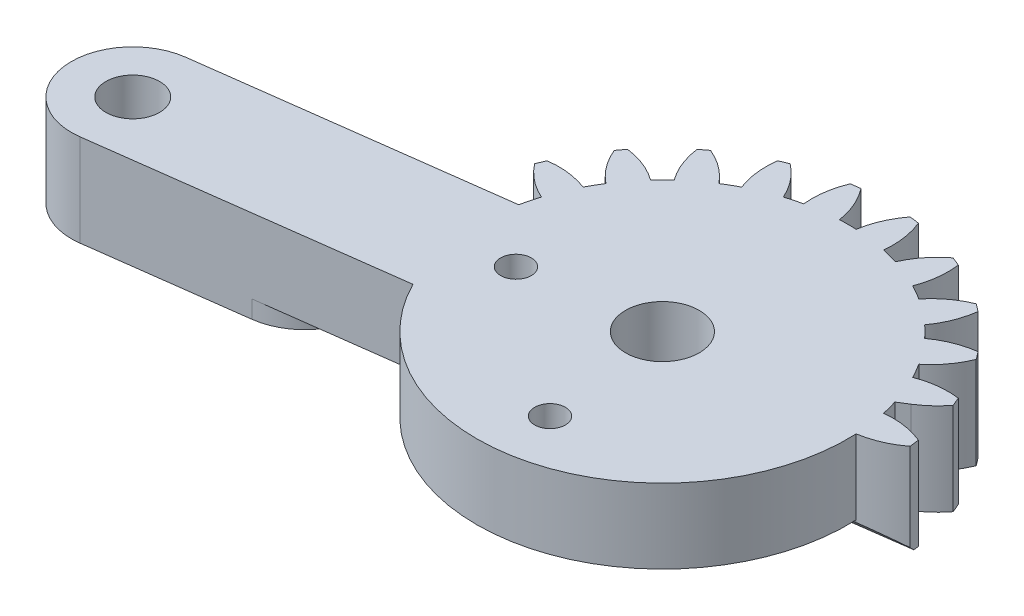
ISO-10303-21;
HEADER;
FILE_DESCRIPTION(('STEP AP214'),'2;1');
FILE_NAME('part.step','',(''),(''),'','','');
FILE_SCHEMA(('AUTOMOTIVE_DESIGN { 1 0 10303 214 1 1 1 1 }'));
ENDSEC;
DATA;
#1=APPLICATION_CONTEXT('core data for automotive mechanical design processes');
#2=APPLICATION_PROTOCOL_DEFINITION('international standard','automotive_design',2000,#1);
#3=PRODUCT_CONTEXT('',#1,'mechanical');
#4=PRODUCT('Part','Part','',(#3));
#5=PRODUCT_RELATED_PRODUCT_CATEGORY('part','',(#4));
#6=PRODUCT_DEFINITION_FORMATION('','',#4);
#7=PRODUCT_DEFINITION_CONTEXT('part definition',#1,'design');
#8=PRODUCT_DEFINITION('design','',#6,#7);
#9=PRODUCT_DEFINITION_SHAPE('','',#8);
#10=(LENGTH_UNIT() NAMED_UNIT(*) SI_UNIT(.MILLI.,.METRE.));
#11=(NAMED_UNIT(*) PLANE_ANGLE_UNIT() SI_UNIT($,.RADIAN.));
#12=(NAMED_UNIT(*) SI_UNIT($,.STERADIAN.) SOLID_ANGLE_UNIT());
#13=UNCERTAINTY_MEASURE_WITH_UNIT(LENGTH_MEASURE(1.E-05),#10,'distance_accuracy_value','');
#14=(GEOMETRIC_REPRESENTATION_CONTEXT(3) GLOBAL_UNCERTAINTY_ASSIGNED_CONTEXT((#13)) GLOBAL_UNIT_ASSIGNED_CONTEXT((#10,
#11,#12)) REPRESENTATION_CONTEXT('',''));
#15=CARTESIAN_POINT('',(0.,0.,0.));
#16=DIRECTION('',(0.,0.,1.));
#17=DIRECTION('',(1.,0.,0.));
#18=AXIS2_PLACEMENT_3D('',#15,#16,#17);
#19=CARTESIAN_POINT('',(-10.1063425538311,4.,0.));
#20=DIRECTION('',(0.,-1.,0.));
#21=DIRECTION('',(0.,0.,-1.));
#22=AXIS2_PLACEMENT_3D('',#19,#20,#21);
#23=CYLINDRICAL_SURFACE('',#22,12.09275);
#24=CARTESIAN_POINT('',(-10.1063425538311,-0.85,0.));
#25=DIRECTION('',(0.,-1.,0.));
#26=DIRECTION('',(0.,0.,-1.));
#27=AXIS2_PLACEMENT_3D('',#24,#25,#26);
#28=CIRCLE('',#27,12.09275);
#29=CARTESIAN_POINT('',(-21.9428533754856,-0.85,-2.47620962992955));
#30=VERTEX_POINT('',#29);
#31=CARTESIAN_POINT('',(-21.9453020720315,-0.85,-2.46447562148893));
#32=VERTEX_POINT('',#31);
#33=EDGE_CURVE('E2056',#30,#32,#28,.F.);
#34=ORIENTED_EDGE('',*,*,#33,.F.);
#35=DIRECTION('',(0.,1.,0.));
#36=VECTOR('',#35,1.);
#37=CARTESIAN_POINT('',(-21.9428533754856,0.,-2.47620962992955));
#38=LINE('',#37,#36);
#39=CARTESIAN_POINT('',(-21.9428533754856,4.,-2.47620962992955));
#40=VERTEX_POINT('',#39);
#41=EDGE_CURVE('E673',#30,#40,#38,.T.);
#42=ORIENTED_EDGE('',*,*,#41,.T.);
#43=CARTESIAN_POINT('',(-10.1063425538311,4.,0.));
#44=DIRECTION('',(0.,1.,0.));
#45=DIRECTION('',(0.,0.,1.));
#46=AXIS2_PLACEMENT_3D('',#43,#44,#45);
#47=CIRCLE('',#46,12.09275);
#48=CARTESIAN_POINT('',(-21.6348055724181,4.,-3.65090988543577));
#49=VERTEX_POINT('',#48);
#50=EDGE_CURVE('E770',#49,#40,#47,.T.);
#51=ORIENTED_EDGE('',*,*,#50,.F.);
#52=DIRECTION('',(0.,-1.,0.));
#53=VECTOR('',#52,1.);
#54=CARTESIAN_POINT('',(-21.6348055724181,4.,-3.65090988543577));
#55=LINE('',#54,#53);
#56=CARTESIAN_POINT('',(-21.6348055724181,-2.,-3.65090988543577));
#57=VERTEX_POINT('',#56);
#58=EDGE_CURVE('E776',#49,#57,#55,.T.);
#59=ORIENTED_EDGE('',*,*,#58,.T.);
#60=CARTESIAN_POINT('',(-10.1063425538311,-2.,0.));
#61=DIRECTION('',(0.,-1.,0.));
#62=DIRECTION('',(0.,0.,-1.));
#63=AXIS2_PLACEMENT_3D('',#60,#61,#62);
#64=CIRCLE('',#63,12.09275);
#65=CARTESIAN_POINT('',(-21.6754343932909,-2.,-3.52004496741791));
#66=VERTEX_POINT('',#65);
#67=EDGE_CURVE('E565',#66,#57,#64,.T.);
#68=ORIENTED_EDGE('',*,*,#67,.F.);
#69=CARTESIAN_POINT('',(-10.1063425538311,2.99999999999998,0.));
#70=DIRECTION('',(-0.0922959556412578,0.707106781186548,-0.701057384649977));
#71=DIRECTION('',(-0.092295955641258,-0.707106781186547,-0.701057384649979));
#72=AXIS2_PLACEMENT_3D('',#69,#70,#71);
#73=ELLIPSE('',#72,17.1017310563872,12.09275);
#74=CARTESIAN_POINT('',(-21.9428533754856,-1.,-2.47620962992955));
#75=VERTEX_POINT('',#74);
#76=EDGE_CURVE('E580',#66,#75,#73,.T.);
#77=ORIENTED_EDGE('',*,*,#76,.T.);
#78=CARTESIAN_POINT('',(-21.9428533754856,-1.,-2.47620962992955));
#79=CARTESIAN_POINT('',(-21.9428526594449,-0.972924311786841,-2.47621036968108));
#80=CARTESIAN_POINT('',(-21.9430921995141,-0.945862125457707,-2.47506831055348));
#81=CARTESIAN_POINT('',(-21.9440429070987,-0.891942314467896,-2.47051835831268));
#82=CARTESIAN_POINT('',(-21.9447539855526,-0.865084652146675,-2.46711089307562));
#83=CARTESIAN_POINT('',(-21.9475749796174,-0.785249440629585,-2.453549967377));
#84=CARTESIAN_POINT('',(-21.9503727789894,-0.732824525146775,-2.4400576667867));
#85=CARTESIAN_POINT('',(-21.957606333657,-0.631062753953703,-2.40467682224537));
#86=CARTESIAN_POINT('',(-21.96204176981,-0.581725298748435,-2.38278991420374));
#87=CARTESIAN_POINT('',(-21.9722583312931,-0.487341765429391,-2.33137941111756));
#88=CARTESIAN_POINT('',(-21.97803992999,-0.442297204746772,-2.30185312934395));
#89=CARTESIAN_POINT('',(-21.9907719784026,-0.356415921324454,-2.235199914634));
#90=CARTESIAN_POINT('',(-21.9977499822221,-0.315727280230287,-2.19788781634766));
#91=CARTESIAN_POINT('',(-22.0123646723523,-0.240907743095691,-2.11728972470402));
#92=CARTESIAN_POINT('',(-22.0200015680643,-0.206778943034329,-2.07400182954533));
#93=CARTESIAN_POINT('',(-22.0359447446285,-0.144257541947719,-1.98029348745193));
#94=CARTESIAN_POINT('',(-22.0442653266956,-0.116244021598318,-1.92962253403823));
#95=CARTESIAN_POINT('',(-22.0608038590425,-0.0689159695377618,-1.82436112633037));
#96=CARTESIAN_POINT('',(-22.0690218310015,-0.0495995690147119,-1.76977151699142));
#97=CARTESIAN_POINT('',(-22.0832793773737,-0.0233243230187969,-1.67019091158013));
#98=CARTESIAN_POINT('',(-22.0894064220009,-0.0145985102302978,-1.62566993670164));
#99=CARTESIAN_POINT('',(-22.1012494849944,-0.00293462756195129,-1.53586869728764));
#100=CARTESIAN_POINT('',(-22.1069659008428,9.11403826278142E-06,-1.49058922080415));
#101=CARTESIAN_POINT('',(-22.1124174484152,0.,-1.44525713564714));
#102=B_SPLINE_CURVE_WITH_KNOTS('',3,(#78,#79,#80,#81,#82,#83,#84,#85,#86,#87,#88,#89,#90,#91,
#92,#93,#94,#95,#96,#97,#98,#99,#100,#101),.UNSPECIFIED.,.F.,.F.,(4,2,2,2,2,2,2,2,2,2,2,4),(0.,
0.0811753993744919,0.162335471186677,0.324107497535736,0.485848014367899,0.647645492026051,
0.813851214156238,0.980109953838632,1.15480754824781,1.32946758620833,1.4664462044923,
1.60329039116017),.UNSPECIFIED.);
#103=EDGE_CURVE('E630',#75,#32,#102,.T.);
#104=ORIENTED_EDGE('',*,*,#103,.T.);
#105=EDGE_LOOP('',(#34,#42,#51,#59,#68,#77,#104));
#106=FACE_BOUND('',#105,.T.);
#107=ADVANCED_FACE('F91',(#106),#23,.T.);
#108=CARTESIAN_POINT('',(20.6436574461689,0.,0.));
#109=DIRECTION('',(0.,1.,0.));
#110=DIRECTION('',(0.,0.,1.));
#111=AXIS2_PLACEMENT_3D('',#108,#109,#110);
#112=PLANE('',#111);
#113=DIRECTION('',(-0.990865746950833,0.,0.134852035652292));
#114=VECTOR('',#113,1.);
#115=CARTESIAN_POINT('',(2.1090746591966,0.,0.448143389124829));
#116=LINE('',#115,#114);
#117=CARTESIAN_POINT('',(-3.10880662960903,0.,1.15827179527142));
#118=VERTEX_POINT('',#117);
#119=CARTESIAN_POINT('',(-2.42999040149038,0.,1.06588818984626));
#120=VERTEX_POINT('',#119);
#121=EDGE_CURVE('E509',#118,#120,#116,.F.);
#122=ORIENTED_EDGE('',*,*,#121,.T.);
#123=CARTESIAN_POINT('',(-10.1063425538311,0.,0.));
#124=DIRECTION('',(0.,-1.,0.));
#125=DIRECTION('',(0.,0.,-1.));
#126=AXIS2_PLACEMENT_3D('',#123,#124,#125);
#127=CIRCLE('',#126,7.75);
#128=CARTESIAN_POINT('',(-4.20411833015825,0.,5.02257396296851));
#129=VERTEX_POINT('',#128);
#130=EDGE_CURVE('E516',#120,#129,#127,.T.);
#131=ORIENTED_EDGE('',*,*,#130,.T.);
#132=DIRECTION('',(-0.99144486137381,0.,0.130526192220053));
#133=VECTOR('',#132,1.);
#134=CARTESIAN_POINT('',(0.578342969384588,0.,4.39295098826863));
#135=LINE('',#134,#133);
#136=CARTESIAN_POINT('',(-14.5075155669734,0.,6.3790419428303));
#137=VERTEX_POINT('',#136);
#138=EDGE_CURVE('E117',#129,#137,#135,.T.);
#139=ORIENTED_EDGE('',*,*,#138,.T.);
#140=CARTESIAN_POINT('',(-10.1063425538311,0.,0.));
#141=DIRECTION('',(0.,-1.,0.));
#142=DIRECTION('',(0.,0.,-1.));
#143=AXIS2_PLACEMENT_3D('',#140,#141,#142);
#144=CIRCLE('',#143,7.75);
#145=CARTESIAN_POINT('',(-15.9131420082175,0.,5.13259974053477));
#146=VERTEX_POINT('',#145);
#147=EDGE_CURVE('E112',#137,#146,#144,.T.);
#148=ORIENTED_EDGE('',*,*,#147,.T.);
#149=DIRECTION('',(-0.130526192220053,0.,-0.99144486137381));
#150=VECTOR('',#149,1.);
#151=CARTESIAN_POINT('',(-16.3062357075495,0.,2.14675665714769));
#152=LINE('',#151,#150);
#153=CARTESIAN_POINT('',(-16.8699969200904,0.,-2.13543489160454));
#154=VERTEX_POINT('',#153);
#155=EDGE_CURVE('E512',#146,#154,#152,.T.);
#156=ORIENTED_EDGE('',*,*,#155,.T.);
#157=CARTESIAN_POINT('',(-10.1063425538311,0.,0.));
#158=DIRECTION('',(0.,1.,0.));
#159=DIRECTION('',(0.,0.,1.));
#160=AXIS2_PLACEMENT_3D('',#157,#158,#159);
#161=CIRCLE('',#160,7.09275);
#162=EDGE_CURVE('E502',#154,#118,#161,.F.);
#163=ORIENTED_EDGE('',*,*,#162,.T.);
#164=EDGE_LOOP('',(#122,#131,#139,#148,#156,#163));
#165=FACE_BOUND('',#164,.T.);
#166=CARTESIAN_POINT('',(-10.1063425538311,0.,0.));
#167=DIRECTION('',(0.,1.,0.));
#168=DIRECTION('',(0.,0.,1.));
#169=AXIS2_PLACEMENT_3D('',#166,#167,#168);
#170=CIRCLE('',#169,2.4);
#171=CARTESIAN_POINT('',(-10.1063425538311,0.,2.39999999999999));
#172=VERTEX_POINT('',#171);
#173=EDGE_CURVE('E1084',#172,#172,#170,.F.);
#174=ORIENTED_EDGE('',*,*,#173,.F.);
#175=EDGE_LOOP('',(#174));
#176=FACE_BOUND('',#175,.T.);
#177=ADVANCED_FACE('F513',(#165,#176),#112,.F.);
#178=CARTESIAN_POINT('',(20.6436574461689,4.,0.));
#179=DIRECTION('',(0.,1.,0.));
#180=DIRECTION('',(0.,0.,1.));
#181=AXIS2_PLACEMENT_3D('',#178,#179,#180);
#182=PLANE('',#181);
#183=CARTESIAN_POINT('',(-8.99686991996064,4.,8.42728132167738));
#184=DIRECTION('',(0.,1.,0.));
#185=DIRECTION('',(0.,0.,1.));
#186=AXIS2_PLACEMENT_3D('',#183,#184,#185);
#187=CIRCLE('',#186,1.);
#188=CARTESIAN_POINT('',(-8.99686991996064,4.,9.42728132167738));
#189=VERTEX_POINT('',#188);
#190=EDGE_CURVE('E1075',#189,#189,#187,.T.);
#191=ORIENTED_EDGE('',*,*,#190,.F.);
#192=EDGE_LOOP('',(#191));
#193=FACE_BOUND('',#192,.T.);
#194=CARTESIAN_POINT('',(-18.5336238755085,4.,1.10947263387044));
#195=DIRECTION('',(0.,1.,0.));
#196=DIRECTION('',(0.,0.,1.));
#197=AXIS2_PLACEMENT_3D('',#194,#195,#196);
#198=CIRCLE('',#197,1.);
#199=CARTESIAN_POINT('',(-18.5336238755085,4.,2.10947263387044));
#200=VERTEX_POINT('',#199);
#201=EDGE_CURVE('E1076',#200,#200,#198,.T.);
#202=ORIENTED_EDGE('',*,*,#201,.F.);
#203=EDGE_LOOP('',(#202));
#204=FACE_BOUND('',#203,.T.);
#205=CARTESIAN_POINT('',(-10.1063425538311,4.,0.));
#206=DIRECTION('',(0.,1.,0.));
#207=DIRECTION('',(0.,0.,1.));
#208=AXIS2_PLACEMENT_3D('',#205,#206,#207);
#209=CIRCLE('',#208,2.4);
#210=CARTESIAN_POINT('',(-10.1063425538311,4.,2.39999999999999));
#211=VERTEX_POINT('',#210);
#212=EDGE_CURVE('E1079',#211,#211,#209,.T.);
#213=ORIENTED_EDGE('',*,*,#212,.F.);
#214=EDGE_LOOP('',(#213));
#215=FACE_BOUND('',#214,.T.);
#216=DIRECTION('',(-0.849390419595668,0.,0.527765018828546));
#217=VECTOR('',#216,1.);
#218=CARTESIAN_POINT('',(-1.21330216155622,4.,-1.95270090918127));
#219=LINE('',#218,#217);
#220=CARTESIAN_POINT('',(2.08164193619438,4.,-4.00000000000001));
#221=VERTEX_POINT('',#220);
#222=CARTESIAN_POINT('',(1.43808022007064,4.,-3.60012574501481));
#223=VERTEX_POINT('',#222);
#224=EDGE_CURVE('E1090',#221,#223,#219,.T.);
#225=ORIENTED_EDGE('',*,*,#224,.F.);
#226=CARTESIAN_POINT('',(-0.768289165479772,4.,-8.58670826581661));
#227=DIRECTION('',(0.,1.,0.));
#228=DIRECTION('',(0.,0.,1.));
#229=AXIS2_PLACEMENT_3D('',#226,#227,#228);
#230=CIRCLE('',#229,5.4);
#231=CARTESIAN_POINT('',(3.52174943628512,4.,-5.30713988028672));
#232=VERTEX_POINT('',#231);
#233=EDGE_CURVE('E690',#221,#232,#230,.T.);
#234=ORIENTED_EDGE('',*,*,#233,.T.);
#235=CARTESIAN_POINT('',(-10.1063425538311,4.,0.));
#236=DIRECTION('',(0.,1.,0.));
#237=DIRECTION('',(0.,0.,1.));
#238=AXIS2_PLACEMENT_3D('',#235,#236,#237);
#239=CIRCLE('',#238,14.625);
#240=CARTESIAN_POINT('',(3.28288830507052,4.,-5.88380166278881));
#241=VERTEX_POINT('',#240);
#242=EDGE_CURVE('E694',#232,#241,#239,.T.);
#243=ORIENTED_EDGE('',*,*,#242,.T.);
#244=CARTESIAN_POINT('',(2.56837796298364,4.,-0.531281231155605));
#245=DIRECTION('',(0.,1.,0.));
#246=DIRECTION('',(0.,0.,1.));
#247=AXIS2_PLACEMENT_3D('',#244,#245,#246);
#248=CIRCLE('',#247,5.4);
#249=CARTESIAN_POINT('',(0.627094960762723,4.,-5.5702712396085));
#250=VERTEX_POINT('',#249);
#251=EDGE_CURVE('E696',#241,#250,#248,.T.);
#252=ORIENTED_EDGE('',*,*,#251,.T.);
#253=CARTESIAN_POINT('',(-10.1063425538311,4.,0.));
#254=DIRECTION('',(0.,1.,0.));
#255=DIRECTION('',(0.,0.,1.));
#256=AXIS2_PLACEMENT_3D('',#253,#254,#255);
#257=CIRCLE('',#256,12.09275);
#258=CARTESIAN_POINT('',(0.0843726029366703,4.,-6.51029393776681));
#259=VERTEX_POINT('',#258);
#260=EDGE_CURVE('E698',#250,#259,#257,.T.);
#261=ORIENTED_EDGE('',*,*,#260,.T.);
#262=CARTESIAN_POINT('',(-3.30887925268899,4.,-10.7109893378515));
#263=DIRECTION('',(0.,1.,0.));
#264=DIRECTION('',(0.,0.,1.));
#265=AXIS2_PLACEMENT_3D('',#262,#263,#264);
#266=CIRCLE('',#265,5.4);
#267=CARTESIAN_POINT('',(1.68379458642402,4.,-8.65351322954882));
#268=VERTEX_POINT('',#267);
#269=EDGE_CURVE('E700',#259,#268,#266,.T.);
#270=ORIENTED_EDGE('',*,*,#269,.T.);
#271=CARTESIAN_POINT('',(-10.1063425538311,4.,0.));
#272=DIRECTION('',(0.,1.,0.));
#273=DIRECTION('',(0.,0.,1.));
#274=AXIS2_PLACEMENT_3D('',#271,#272,#273);
#275=CIRCLE('',#274,14.625);
#276=CARTESIAN_POINT('',(1.30382139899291,4.,-9.1487039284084));
#277=VERTEX_POINT('',#276);
#278=EDGE_CURVE('E702',#268,#277,#275,.T.);
#279=ORIENTED_EDGE('',*,*,#278,.T.);
#280=CARTESIAN_POINT('',(1.9989916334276,4.,-3.79363732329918));
#281=DIRECTION('',(0.,1.,0.));
#282=DIRECTION('',(0.,0.,1.));
#283=AXIS2_PLACEMENT_3D('',#280,#281,#282);
#284=CIRCLE('',#283,5.4);
#285=CARTESIAN_POINT('',(-1.18033033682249,4.,-8.15848689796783));
#286=VERTEX_POINT('',#285);
#287=EDGE_CURVE('E704',#277,#286,#284,.T.);
#288=ORIENTED_EDGE('',*,*,#287,.T.);
#289=CARTESIAN_POINT('',(-10.1063425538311,4.,0.));
#290=DIRECTION('',(0.,1.,0.));
#291=DIRECTION('',(0.,0.,1.));
#292=AXIS2_PLACEMENT_3D('',#289,#290,#291);
#293=CIRCLE('',#292,12.09275);
#294=CARTESIAN_POINT('',(-1.9478556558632,4.,-8.92601221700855));
#295=VERTEX_POINT('',#294);
#296=EDGE_CURVE('E706',#286,#295,#293,.T.);
#297=ORIENTED_EDGE('',*,*,#296,.T.);
#298=CARTESIAN_POINT('',(-6.31270523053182,4.,-12.1053341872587));
#299=DIRECTION('',(0.,1.,0.));
#300=DIRECTION('',(0.,0.,1.));
#301=AXIS2_PLACEMENT_3D('',#298,#299,#300);
#302=CIRCLE('',#301,5.4);
#303=CARTESIAN_POINT('',(-0.957638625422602,4.,-11.4101639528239));
#304=VERTEX_POINT('',#303);
#305=EDGE_CURVE('E708',#295,#304,#302,.T.);
#306=ORIENTED_EDGE('',*,*,#305,.T.);
#307=CARTESIAN_POINT('',(-10.1063425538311,4.,0.));
#308=DIRECTION('',(0.,1.,0.));
#309=DIRECTION('',(0.,0.,1.));
#310=AXIS2_PLACEMENT_3D('',#307,#308,#309);
#311=CIRCLE('',#310,14.625);
#312=CARTESIAN_POINT('',(-1.45282932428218,4.,-11.7901371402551));
#313=VERTEX_POINT('',#312);
#314=EDGE_CURVE('E710',#304,#313,#311,.T.);
#315=ORIENTED_EDGE('',*,*,#314,.T.);
#316=CARTESIAN_POINT('',(0.604646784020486,4.,-6.79746330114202));
#317=DIRECTION('',(0.,1.,0.));
#318=DIRECTION('',(0.,0.,1.));
#319=AXIS2_PLACEMENT_3D('',#316,#317,#318);
#320=CIRCLE('',#319,5.4);
#321=CARTESIAN_POINT('',(-3.59604861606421,4.,-10.1907151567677));
#322=VERTEX_POINT('',#321);
#323=EDGE_CURVE('E712',#313,#322,#320,.T.);
#324=ORIENTED_EDGE('',*,*,#323,.T.);
#325=CARTESIAN_POINT('',(-10.1063425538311,4.,0.));
#326=DIRECTION('',(0.,1.,0.));
#327=DIRECTION('',(0.,0.,1.));
#328=AXIS2_PLACEMENT_3D('',#325,#326,#327);
#329=CIRCLE('',#328,12.09275);
#330=CARTESIAN_POINT('',(-4.53607131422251,4.,-10.7334375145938));
#331=VERTEX_POINT('',#330);
#332=EDGE_CURVE('E714',#322,#331,#329,.T.);
#333=ORIENTED_EDGE('',*,*,#332,.T.);
#334=CARTESIAN_POINT('',(-9.57506132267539,4.,-12.6747205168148));
#335=DIRECTION('',(0.,1.,0.));
#336=DIRECTION('',(0.,0.,1.));
#337=AXIS2_PLACEMENT_3D('',#334,#335,#336);
#338=CIRCLE('',#337,5.4);
#339=CARTESIAN_POINT('',(-4.22254089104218,4.,-13.3892308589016));
#340=VERTEX_POINT('',#339);
#341=EDGE_CURVE('E716',#331,#340,#338,.T.);
#342=ORIENTED_EDGE('',*,*,#341,.T.);
#343=CARTESIAN_POINT('',(-10.1063425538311,4.,0.));
#344=DIRECTION('',(0.,1.,0.));
#345=DIRECTION('',(0.,0.,1.));
#346=AXIS2_PLACEMENT_3D('',#343,#344,#345);
#347=CIRCLE('',#346,14.625);
#348=CARTESIAN_POINT('',(-4.79920267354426,4.,-13.6280919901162));
#349=VERTEX_POINT('',#348);
#350=EDGE_CURVE('E718',#340,#349,#347,.T.);
#351=ORIENTED_EDGE('',*,*,#350,.T.);
#352=CARTESIAN_POINT('',(-1.51963428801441,4.,-9.33805338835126));
#353=DIRECTION('',(0.,1.,0.));
#354=DIRECTION('',(0.,0.,1.));
#355=AXIS2_PLACEMENT_3D('',#352,#353,#354);
#356=CIRCLE('',#355,5.4);
#357=CARTESIAN_POINT('',(-6.45543266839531,4.,-11.528463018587));
#358=VERTEX_POINT('',#357);
#359=EDGE_CURVE('E720',#349,#358,#356,.T.);
#360=ORIENTED_EDGE('',*,*,#359,.T.);
#361=CARTESIAN_POINT('',(-10.1063425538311,4.,0.));
#362=DIRECTION('',(0.,1.,0.));
#363=DIRECTION('',(0.,0.,1.));
#364=AXIS2_PLACEMENT_3D('',#361,#362,#363);
#365=CIRCLE('',#364,12.09275);
#366=CARTESIAN_POINT('',(-7.50389175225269,4.,-11.8093967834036));
#367=VERTEX_POINT('',#366);
#368=EDGE_CURVE('E722',#358,#367,#365,.T.);
#369=ORIENTED_EDGE('',*,*,#368,.T.);
#370=CARTESIAN_POINT('',(-12.8736233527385,4.,-12.3803455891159));
#371=DIRECTION('',(0.,1.,0.));
#372=DIRECTION('',(0.,0.,1.));
#373=AXIS2_PLACEMENT_3D('',#370,#371,#372);
#374=CIRCLE('',#373,5.4);
#375=CARTESIAN_POINT('',(-7.88841451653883,4.,-14.4558438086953));
#376=VERTEX_POINT('',#375);
#377=EDGE_CURVE('E724',#367,#376,#374,.T.);
#378=ORIENTED_EDGE('',*,*,#377,.T.);
#379=CARTESIAN_POINT('',(-10.1063425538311,4.,0.));
#380=DIRECTION('',(0.,1.,0.));
#381=DIRECTION('',(0.,0.,1.));
#382=AXIS2_PLACEMENT_3D('',#379,#380,#381);
#383=CIRCLE('',#382,14.625);
#384=CARTESIAN_POINT('',(-8.50724883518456,4.,-14.5373148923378));
#385=VERTEX_POINT('',#384);
#386=EDGE_CURVE('E726',#376,#385,#383,.T.);
#387=ORIENTED_EDGE('',*,*,#386,.T.);
#388=CARTESIAN_POINT('',(-4.22908533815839,4.,-11.2422705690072));
#389=DIRECTION('',(0.,1.,0.));
#390=DIRECTION('',(0.,0.,1.));
#391=AXIS2_PLACEMENT_3D('',#388,#389,#390);
#392=CIRCLE('',#391,5.4);
#393=CARTESIAN_POINT('',(-9.56362019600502,4.,-12.0805651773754));
#394=VERTEX_POINT('',#393);
#395=EDGE_CURVE('E728',#385,#394,#392,.T.);
#396=ORIENTED_EDGE('',*,*,#395,.T.);
#397=CARTESIAN_POINT('',(-10.1063425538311,4.,0.));
#398=DIRECTION('',(0.,1.,0.));
#399=DIRECTION('',(0.,0.,1.));
#400=AXIS2_PLACEMENT_3D('',#397,#398,#399);
#401=CIRCLE('',#400,12.09275);
#402=CARTESIAN_POINT('',(-10.6490649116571,4.,-12.0805651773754));
#403=VERTEX_POINT('',#402);
#404=EDGE_CURVE('E730',#394,#403,#401,.T.);
#405=ORIENTED_EDGE('',*,*,#404,.T.);
#406=CARTESIAN_POINT('',(-15.9835997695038,4.,-11.2422705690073));
#407=DIRECTION('',(0.,1.,0.));
#408=DIRECTION('',(0.,0.,1.));
#409=AXIS2_PLACEMENT_3D('',#406,#407,#408);
#410=CIRCLE('',#409,5.4);
#411=CARTESIAN_POINT('',(-11.7054362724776,4.,-14.5373148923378));
#412=VERTEX_POINT('',#411);
#413=EDGE_CURVE('E732',#403,#412,#410,.T.);
#414=ORIENTED_EDGE('',*,*,#413,.T.);
#415=CARTESIAN_POINT('',(-10.1063425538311,4.,0.));
#416=DIRECTION('',(0.,1.,0.));
#417=DIRECTION('',(0.,0.,1.));
#418=AXIS2_PLACEMENT_3D('',#415,#416,#417);
#419=CIRCLE('',#418,14.625);
#420=CARTESIAN_POINT('',(-12.3242705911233,4.,-14.4558438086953));
#421=VERTEX_POINT('',#420);
#422=EDGE_CURVE('E734',#412,#421,#419,.T.);
#423=ORIENTED_EDGE('',*,*,#422,.T.);
#424=CARTESIAN_POINT('',(-7.33906175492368,4.,-12.3803455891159));
#425=DIRECTION('',(0.,1.,0.));
#426=DIRECTION('',(0.,0.,1.));
#427=AXIS2_PLACEMENT_3D('',#424,#425,#426);
#428=CIRCLE('',#427,5.4);
#429=CARTESIAN_POINT('',(-12.7087933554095,4.,-11.8093967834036));
#430=VERTEX_POINT('',#429);
#431=EDGE_CURVE('E736',#421,#430,#428,.T.);
#432=ORIENTED_EDGE('',*,*,#431,.T.);
#433=CARTESIAN_POINT('',(-10.1063425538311,4.,0.));
#434=DIRECTION('',(0.,1.,0.));
#435=DIRECTION('',(0.,0.,1.));
#436=AXIS2_PLACEMENT_3D('',#433,#434,#435);
#437=CIRCLE('',#436,12.09275);
#438=CARTESIAN_POINT('',(-13.7572524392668,4.,-11.528463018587));
#439=VERTEX_POINT('',#438);
#440=EDGE_CURVE('E738',#430,#439,#437,.T.);
#441=ORIENTED_EDGE('',*,*,#440,.T.);
#442=CARTESIAN_POINT('',(-18.6930508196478,4.,-9.33805338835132));
#443=DIRECTION('',(0.,1.,0.));
#444=DIRECTION('',(0.,0.,1.));
#445=AXIS2_PLACEMENT_3D('',#442,#443,#444);
#446=CIRCLE('',#445,5.4);
#447=CARTESIAN_POINT('',(-15.4134824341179,4.,-13.6280919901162));
#448=VERTEX_POINT('',#447);
#449=EDGE_CURVE('E740',#439,#448,#446,.T.);
#450=ORIENTED_EDGE('',*,*,#449,.T.);
#451=CARTESIAN_POINT('',(-10.1063425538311,4.,0.));
#452=DIRECTION('',(0.,1.,0.));
#453=DIRECTION('',(0.,0.,1.));
#454=AXIS2_PLACEMENT_3D('',#451,#452,#453);
#455=CIRCLE('',#454,14.625);
#456=CARTESIAN_POINT('',(-15.99014421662,4.,-13.3892308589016));
#457=VERTEX_POINT('',#456);
#458=EDGE_CURVE('E742',#448,#457,#455,.T.);
#459=ORIENTED_EDGE('',*,*,#458,.T.);
#460=CARTESIAN_POINT('',(-10.6376237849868,4.,-12.6747205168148));
#461=DIRECTION('',(0.,1.,0.));
#462=DIRECTION('',(0.,0.,1.));
#463=AXIS2_PLACEMENT_3D('',#460,#461,#462);
#464=CIRCLE('',#463,5.4);
#465=CARTESIAN_POINT('',(-15.6766137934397,4.,-10.7334375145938));
#466=VERTEX_POINT('',#465);
#467=EDGE_CURVE('E744',#457,#466,#464,.T.);
#468=ORIENTED_EDGE('',*,*,#467,.T.);
#469=CARTESIAN_POINT('',(-10.1063425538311,4.,0.));
#470=DIRECTION('',(0.,1.,0.));
#471=DIRECTION('',(0.,0.,1.));
#472=AXIS2_PLACEMENT_3D('',#469,#470,#471);
#473=CIRCLE('',#472,12.09275);
#474=CARTESIAN_POINT('',(-16.616636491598,4.,-10.1907151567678));
#475=VERTEX_POINT('',#474);
#476=EDGE_CURVE('E746',#466,#475,#473,.T.);
#477=ORIENTED_EDGE('',*,*,#476,.T.);
#478=CARTESIAN_POINT('',(-20.8173318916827,4.,-6.79746330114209));
#479=DIRECTION('',(0.,1.,0.));
#480=DIRECTION('',(0.,0.,1.));
#481=AXIS2_PLACEMENT_3D('',#478,#479,#480);
#482=CIRCLE('',#481,5.4);
#483=CARTESIAN_POINT('',(-18.75985578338,4.,-11.7901371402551));
#484=VERTEX_POINT('',#483);
#485=EDGE_CURVE('E748',#475,#484,#482,.T.);
#486=ORIENTED_EDGE('',*,*,#485,.T.);
#487=CARTESIAN_POINT('',(-10.1063425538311,4.,0.));
#488=DIRECTION('',(0.,1.,0.));
#489=DIRECTION('',(0.,0.,1.));
#490=AXIS2_PLACEMENT_3D('',#487,#488,#489);
#491=CIRCLE('',#490,14.625);
#492=CARTESIAN_POINT('',(-19.2550464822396,4.,-11.410163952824));
#493=VERTEX_POINT('',#492);
#494=EDGE_CURVE('E750',#484,#493,#491,.T.);
#495=ORIENTED_EDGE('',*,*,#494,.T.);
#496=CARTESIAN_POINT('',(-13.8999798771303,4.,-12.1053341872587));
#497=DIRECTION('',(0.,1.,0.));
#498=DIRECTION('',(0.,0.,1.));
#499=AXIS2_PLACEMENT_3D('',#496,#497,#498);
#500=CIRCLE('',#499,5.4);
#501=CARTESIAN_POINT('',(-18.264829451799,4.,-8.92601221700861));
#502=VERTEX_POINT('',#501);
#503=EDGE_CURVE('E752',#493,#502,#500,.T.);
#504=ORIENTED_EDGE('',*,*,#503,.T.);
#505=CARTESIAN_POINT('',(-10.1063425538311,4.,0.));
#506=DIRECTION('',(0.,1.,0.));
#507=DIRECTION('',(0.,0.,1.));
#508=AXIS2_PLACEMENT_3D('',#505,#506,#507);
#509=CIRCLE('',#508,12.09275);
#510=CARTESIAN_POINT('',(-19.0323547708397,4.,-8.15848689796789));
#511=VERTEX_POINT('',#510);
#512=EDGE_CURVE('E754',#502,#511,#509,.T.);
#513=ORIENTED_EDGE('',*,*,#512,.T.);
#514=CARTESIAN_POINT('',(-22.2116767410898,4.,-3.79363732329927));
#515=DIRECTION('',(0.,1.,0.));
#516=DIRECTION('',(0.,0.,1.));
#517=AXIS2_PLACEMENT_3D('',#514,#515,#516);
#518=CIRCLE('',#517,5.4);
#519=CARTESIAN_POINT('',(-21.5165065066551,4.,-9.14870392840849));
#520=VERTEX_POINT('',#519);
#521=EDGE_CURVE('E756',#511,#520,#518,.T.);
#522=ORIENTED_EDGE('',*,*,#521,.T.);
#523=CARTESIAN_POINT('',(-10.1063425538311,4.,0.));
#524=DIRECTION('',(0.,1.,0.));
#525=DIRECTION('',(0.,0.,1.));
#526=AXIS2_PLACEMENT_3D('',#523,#524,#525);
#527=CIRCLE('',#526,14.625);
#528=CARTESIAN_POINT('',(-21.8964796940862,4.,-8.65351322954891));
#529=VERTEX_POINT('',#528);
#530=EDGE_CURVE('E758',#520,#529,#527,.T.);
#531=ORIENTED_EDGE('',*,*,#530,.T.);
#532=CARTESIAN_POINT('',(-16.9038058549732,4.,-10.7109893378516));
#533=DIRECTION('',(0.,1.,0.));
#534=DIRECTION('',(0.,0.,1.));
#535=AXIS2_PLACEMENT_3D('',#532,#533,#534);
#536=CIRCLE('',#535,5.4);
#537=CARTESIAN_POINT('',(-20.2970577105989,4.,-6.51029393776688));
#538=VERTEX_POINT('',#537);
#539=EDGE_CURVE('E760',#529,#538,#536,.T.);
#540=ORIENTED_EDGE('',*,*,#539,.T.);
#541=CARTESIAN_POINT('',(-10.1063425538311,4.,0.));
#542=DIRECTION('',(0.,1.,0.));
#543=DIRECTION('',(0.,0.,1.));
#544=AXIS2_PLACEMENT_3D('',#541,#542,#543);
#545=CIRCLE('',#544,12.09275);
#546=CARTESIAN_POINT('',(-20.8397800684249,4.,-5.57027123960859));
#547=VERTEX_POINT('',#546);
#548=EDGE_CURVE('E762',#538,#547,#545,.T.);
#549=ORIENTED_EDGE('',*,*,#548,.T.);
#550=CARTESIAN_POINT('',(-22.7810630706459,4.,-0.531281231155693));
#551=DIRECTION('',(0.,1.,0.));
#552=DIRECTION('',(0.,0.,1.));
#553=AXIS2_PLACEMENT_3D('',#550,#551,#552);
#554=CIRCLE('',#553,5.4);
#555=CARTESIAN_POINT('',(-23.4955734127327,4.,-5.8838016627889));
#556=VERTEX_POINT('',#555);
#557=EDGE_CURVE('E764',#547,#556,#554,.T.);
#558=ORIENTED_EDGE('',*,*,#557,.T.);
#559=CARTESIAN_POINT('',(-10.1063425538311,4.,0.));
#560=DIRECTION('',(0.,1.,0.));
#561=DIRECTION('',(0.,0.,1.));
#562=AXIS2_PLACEMENT_3D('',#559,#560,#561);
#563=CIRCLE('',#562,14.625);
#564=CARTESIAN_POINT('',(-23.7344345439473,4.,-5.30713988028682));
#565=VERTEX_POINT('',#564);
#566=EDGE_CURVE('E766',#556,#565,#563,.T.);
#567=ORIENTED_EDGE('',*,*,#566,.T.);
#568=CARTESIAN_POINT('',(-19.4443959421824,4.,-8.58670826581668));
#569=DIRECTION('',(0.,1.,0.));
#570=DIRECTION('',(0.,0.,1.));
#571=AXIS2_PLACEMENT_3D('',#568,#569,#570);
#572=CIRCLE('',#571,5.4);
#573=EDGE_CURVE('E768',#565,#49,#572,.T.);
#574=ORIENTED_EDGE('',*,*,#573,.T.);
#575=ORIENTED_EDGE('',*,*,#50,.T.);
#576=DIRECTION('',(-0.99144486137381,0.,0.130526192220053));
#577=VECTOR('',#576,1.);
#578=CARTESIAN_POINT('',(-0.694287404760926,4.,-5.27363641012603));
#579=LINE('',#578,#577);
#580=CARTESIAN_POINT('',(-41.115376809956,4.,0.0479009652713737));
#581=VERTEX_POINT('',#580);
#582=EDGE_CURVE('E678',#40,#581,#579,.T.);
#583=ORIENTED_EDGE('',*,*,#582,.T.);
#584=CARTESIAN_POINT('',(-40.5932720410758,4.,4.01368041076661));
#585=DIRECTION('',(0.,1.,0.));
#586=DIRECTION('',(0.,0.,1.));
#587=AXIS2_PLACEMENT_3D('',#584,#585,#586);
#588=CIRCLE('',#587,4.);
#589=CARTESIAN_POINT('',(-40.0711672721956,4.,7.97945985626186));
#590=VERTEX_POINT('',#589);
#591=EDGE_CURVE('E680',#581,#590,#588,.T.);
#592=ORIENTED_EDGE('',*,*,#591,.T.);
#593=DIRECTION('',(-0.99144486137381,0.,0.130526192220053));
#594=VECTOR('',#593,1.);
#595=CARTESIAN_POINT('',(0.349922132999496,4.,2.65792248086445));
#596=LINE('',#595,#594);
#597=CARTESIAN_POINT('',(-20.8986438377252,4.,5.45534926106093));
#598=VERTEX_POINT('',#597);
#599=EDGE_CURVE('E676',#598,#590,#596,.T.);
#600=ORIENTED_EDGE('',*,*,#599,.F.);
#601=CARTESIAN_POINT('',(-10.1063425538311,4.,0.));
#602=DIRECTION('',(0.,1.,0.));
#603=DIRECTION('',(0.,0.,1.));
#604=AXIS2_PLACEMENT_3D('',#601,#602,#603);
#605=CIRCLE('',#604,12.09275);
#606=CARTESIAN_POINT('',(1.97422262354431,4.,-0.542722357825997));
#607=VERTEX_POINT('',#606);
#608=EDGE_CURVE('E773',#598,#607,#605,.T.);
#609=ORIENTED_EDGE('',*,*,#608,.T.);
#610=CARTESIAN_POINT('',(1.13592801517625,4.,-5.87725721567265));
#611=DIRECTION('',(0.,1.,0.));
#612=DIRECTION('',(0.,0.,1.));
#613=AXIS2_PLACEMENT_3D('',#610,#611,#612);
#614=CIRCLE('',#613,5.4);
#615=CARTESIAN_POINT('',(4.43097233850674,4.,-1.59909371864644));
#616=VERTEX_POINT('',#615);
#617=EDGE_CURVE('E1088',#607,#616,#614,.T.);
#618=ORIENTED_EDGE('',*,*,#617,.T.);
#619=CARTESIAN_POINT('',(-10.1063425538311,4.,0.));
#620=DIRECTION('',(0.,1.,0.));
#621=DIRECTION('',(0.,0.,1.));
#622=AXIS2_PLACEMENT_3D('',#619,#620,#621);
#623=CIRCLE('',#622,14.6250000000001);
#624=CARTESIAN_POINT('',(4.34950125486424,4.,-2.21792803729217));
#625=VERTEX_POINT('',#624);
#626=EDGE_CURVE('E656',#616,#625,#623,.T.);
#627=ORIENTED_EDGE('',*,*,#626,.T.);
#628=CARTESIAN_POINT('',(2.27400303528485,4.,2.76728079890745));
#629=DIRECTION('',(0.,1.,0.));
#630=DIRECTION('',(0.,0.,1.));
#631=AXIS2_PLACEMENT_3D('',#628,#629,#630);
#632=CIRCLE('',#631,5.4);
#633=CARTESIAN_POINT('',(1.70305422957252,4.,-2.60245080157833));
#634=VERTEX_POINT('',#633);
#635=EDGE_CURVE('E661',#625,#634,#632,.T.);
#636=ORIENTED_EDGE('',*,*,#635,.T.);
#637=CARTESIAN_POINT('',(-10.1063425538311,4.,0.));
#638=DIRECTION('',(0.,1.,0.));
#639=DIRECTION('',(0.,0.,1.));
#640=AXIS2_PLACEMENT_3D('',#637,#638,#639);
#641=CIRCLE('',#640,12.09275);
#642=EDGE_CURVE('E666',#634,#223,#641,.T.);
#643=ORIENTED_EDGE('',*,*,#642,.T.);
#644=EDGE_LOOP('',(#225,#234,#243,#252,#261,#270,#279,#288,#297,#306,#315,#324,#333,#342,#351,
#360,#369,#378,#387,#396,#405,#414,#423,#432,#441,#450,#459,#468,#477,#486,#495,#504,#513,#522,
#531,#540,#549,#558,#567,#574,#575,#583,#592,#600,#609,#618,#627,#636,#643));
#645=FACE_BOUND('',#644,.T.);
#646=CARTESIAN_POINT('',(-40.5932720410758,4.,4.01368041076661));
#647=DIRECTION('',(0.,1.,0.));
#648=DIRECTION('',(0.,0.,1.));
#649=AXIS2_PLACEMENT_3D('',#646,#647,#648);
#650=CIRCLE('',#649,1.75);
#651=CARTESIAN_POINT('',(-40.5932720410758,4.,5.76368041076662));
#652=VERTEX_POINT('',#651);
#653=EDGE_CURVE('E683',#652,#652,#650,.T.);
#654=ORIENTED_EDGE('',*,*,#653,.F.);
#655=EDGE_LOOP('',(#654));
#656=FACE_BOUND('',#655,.T.);
#657=ADVANCED_FACE('F1022',(#193,#204,#215,#645,#656),#182,.T.);
#658=CARTESIAN_POINT('',(-0.768289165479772,4.,-8.58670826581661));
#659=DIRECTION('',(0.,-1.,0.));
#660=DIRECTION('',(0.,0.,-1.));
#661=AXIS2_PLACEMENT_3D('',#658,#659,#660);
#662=CYLINDRICAL_SURFACE('',#661,5.4);
#663=DIRECTION('',(0.,-1.,0.));
#664=VECTOR('',#663,1.);
#665=CARTESIAN_POINT('',(2.08164193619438,4.,-4.00000000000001));
#666=LINE('',#665,#664);
#667=CARTESIAN_POINT('',(2.08164193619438,-2.,-4.00000000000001));
#668=VERTEX_POINT('',#667);
#669=EDGE_CURVE('E855',#221,#668,#666,.T.);
#670=ORIENTED_EDGE('',*,*,#669,.T.);
#671=CARTESIAN_POINT('',(-0.768289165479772,-2.,-8.58670826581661));
#672=DIRECTION('',(0.,-1.,0.));
#673=DIRECTION('',(0.,0.,-1.));
#674=AXIS2_PLACEMENT_3D('',#671,#672,#673);
#675=CIRCLE('',#674,5.4);
#676=CARTESIAN_POINT('',(3.52174943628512,-2.,-5.30713988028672));
#677=VERTEX_POINT('',#676);
#678=EDGE_CURVE('E1033',#677,#668,#675,.T.);
#679=ORIENTED_EDGE('',*,*,#678,.F.);
#680=DIRECTION('',(0.,-1.,0.));
#681=VECTOR('',#680,1.);
#682=CARTESIAN_POINT('',(3.52174943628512,4.,-5.30713988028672));
#683=LINE('',#682,#681);
#684=EDGE_CURVE('E853',#232,#677,#683,.T.);
#685=ORIENTED_EDGE('',*,*,#684,.F.);
#686=ORIENTED_EDGE('',*,*,#233,.F.);
#687=EDGE_LOOP('',(#670,#679,#685,#686));
#688=FACE_BOUND('',#687,.T.);
#689=ADVANCED_FACE('F1019',(#688),#662,.T.);
#690=CARTESIAN_POINT('',(-10.1063425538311,4.,0.));
#691=DIRECTION('',(0.,-1.,0.));
#692=DIRECTION('',(0.,0.,-1.));
#693=AXIS2_PLACEMENT_3D('',#690,#691,#692);
#694=CYLINDRICAL_SURFACE('',#693,14.625);
#695=ORIENTED_EDGE('',*,*,#684,.T.);
#696=CARTESIAN_POINT('',(-10.1063425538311,-2.,0.));
#697=DIRECTION('',(0.,-1.,0.));
#698=DIRECTION('',(0.,0.,-1.));
#699=AXIS2_PLACEMENT_3D('',#696,#697,#698);
#700=CIRCLE('',#699,14.625);
#701=CARTESIAN_POINT('',(3.28288830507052,-2.,-5.88380166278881));
#702=VERTEX_POINT('',#701);
#703=EDGE_CURVE('E1045',#702,#677,#700,.T.);
#704=ORIENTED_EDGE('',*,*,#703,.F.);
#705=DIRECTION('',(0.,-1.,0.));
#706=VECTOR('',#705,1.);
#707=CARTESIAN_POINT('',(3.28288830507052,4.,-5.88380166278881));
#708=LINE('',#707,#706);
#709=EDGE_CURVE('E851',#241,#702,#708,.T.);
#710=ORIENTED_EDGE('',*,*,#709,.F.);
#711=ORIENTED_EDGE('',*,*,#242,.F.);
#712=EDGE_LOOP('',(#695,#704,#710,#711));
#713=FACE_BOUND('',#712,.T.);
#714=ADVANCED_FACE('F1016',(#713),#694,.T.);
#715=CARTESIAN_POINT('',(2.56837796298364,4.,-0.531281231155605));
#716=DIRECTION('',(0.,-1.,0.));
#717=DIRECTION('',(0.,0.,-1.));
#718=AXIS2_PLACEMENT_3D('',#715,#716,#717);
#719=CYLINDRICAL_SURFACE('',#718,5.4);
#720=ORIENTED_EDGE('',*,*,#709,.T.);
#721=CARTESIAN_POINT('',(2.56837796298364,-2.,-0.531281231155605));
#722=DIRECTION('',(0.,-1.,0.));
#723=DIRECTION('',(0.,0.,-1.));
#724=AXIS2_PLACEMENT_3D('',#721,#722,#723);
#725=CIRCLE('',#724,5.4);
#726=CARTESIAN_POINT('',(0.62709496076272,-2.,-5.5702712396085));
#727=VERTEX_POINT('',#726);
#728=EDGE_CURVE('E2187',#727,#702,#725,.T.);
#729=ORIENTED_EDGE('',*,*,#728,.F.);
#730=DIRECTION('',(0.,-1.,0.));
#731=VECTOR('',#730,1.);
#732=CARTESIAN_POINT('',(0.627094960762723,4.,-5.5702712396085));
#733=LINE('',#732,#731);
#734=EDGE_CURVE('E849',#250,#727,#733,.T.);
#735=ORIENTED_EDGE('',*,*,#734,.F.);
#736=ORIENTED_EDGE('',*,*,#251,.F.);
#737=EDGE_LOOP('',(#720,#729,#735,#736));
#738=FACE_BOUND('',#737,.T.);
#739=ADVANCED_FACE('F1012',(#738),#719,.T.);
#740=CARTESIAN_POINT('',(-10.1063425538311,4.,0.));
#741=DIRECTION('',(0.,-1.,0.));
#742=DIRECTION('',(0.,0.,-1.));
#743=AXIS2_PLACEMENT_3D('',#740,#741,#742);
#744=CYLINDRICAL_SURFACE('',#743,12.09275);
#745=ORIENTED_EDGE('',*,*,#734,.T.);
#746=CARTESIAN_POINT('',(-10.1063425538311,-2.,0.));
#747=DIRECTION('',(0.,-1.,0.));
#748=DIRECTION('',(0.,0.,-1.));
#749=AXIS2_PLACEMENT_3D('',#746,#747,#748);
#750=CIRCLE('',#749,12.09275);
#751=CARTESIAN_POINT('',(0.0843726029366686,-2.,-6.51029393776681));
#752=VERTEX_POINT('',#751);
#753=EDGE_CURVE('E2184',#752,#727,#750,.T.);
#754=ORIENTED_EDGE('',*,*,#753,.F.);
#755=DIRECTION('',(0.,-1.,0.));
#756=VECTOR('',#755,1.);
#757=CARTESIAN_POINT('',(0.0843726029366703,4.,-6.51029393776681));
#758=LINE('',#757,#756);
#759=EDGE_CURVE('E847',#259,#752,#758,.T.);
#760=ORIENTED_EDGE('',*,*,#759,.F.);
#761=ORIENTED_EDGE('',*,*,#260,.F.);
#762=EDGE_LOOP('',(#745,#754,#760,#761));
#763=FACE_BOUND('',#762,.T.);
#764=ADVANCED_FACE('F1008',(#763),#744,.T.);
#765=CARTESIAN_POINT('',(-3.30887925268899,4.,-10.7109893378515));
#766=DIRECTION('',(0.,-1.,0.));
#767=DIRECTION('',(0.,0.,-1.));
#768=AXIS2_PLACEMENT_3D('',#765,#766,#767);
#769=CYLINDRICAL_SURFACE('',#768,5.4);
#770=ORIENTED_EDGE('',*,*,#759,.T.);
#771=CARTESIAN_POINT('',(-3.30887925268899,-2.,-10.7109893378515));
#772=DIRECTION('',(0.,-1.,0.));
#773=DIRECTION('',(0.,0.,-1.));
#774=AXIS2_PLACEMENT_3D('',#771,#772,#773);
#775=CIRCLE('',#774,5.4);
#776=CARTESIAN_POINT('',(1.68379458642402,-2.,-8.65351322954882));
#777=VERTEX_POINT('',#776);
#778=EDGE_CURVE('E2181',#777,#752,#775,.T.);
#779=ORIENTED_EDGE('',*,*,#778,.F.);
#780=DIRECTION('',(0.,-1.,0.));
#781=VECTOR('',#780,1.);
#782=CARTESIAN_POINT('',(1.68379458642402,4.,-8.65351322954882));
#783=LINE('',#782,#781);
#784=EDGE_CURVE('E845',#268,#777,#783,.T.);
#785=ORIENTED_EDGE('',*,*,#784,.F.);
#786=ORIENTED_EDGE('',*,*,#269,.F.);
#787=EDGE_LOOP('',(#770,#779,#785,#786));
#788=FACE_BOUND('',#787,.T.);
#789=ADVANCED_FACE('F1004',(#788),#769,.T.);
#790=CARTESIAN_POINT('',(-10.1063425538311,4.,0.));
#791=DIRECTION('',(0.,-1.,0.));
#792=DIRECTION('',(0.,0.,-1.));
#793=AXIS2_PLACEMENT_3D('',#790,#791,#792);
#794=CYLINDRICAL_SURFACE('',#793,14.625);
#795=ORIENTED_EDGE('',*,*,#784,.T.);
#796=CARTESIAN_POINT('',(-10.1063425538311,-2.,0.));
#797=DIRECTION('',(0.,-1.,0.));
#798=DIRECTION('',(0.,0.,-1.));
#799=AXIS2_PLACEMENT_3D('',#796,#797,#798);
#800=CIRCLE('',#799,14.625);
#801=CARTESIAN_POINT('',(1.3038213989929,-2.,-9.14870392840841));
#802=VERTEX_POINT('',#801);
#803=EDGE_CURVE('E2178',#802,#777,#800,.T.);
#804=ORIENTED_EDGE('',*,*,#803,.F.);
#805=DIRECTION('',(0.,-1.,0.));
#806=VECTOR('',#805,1.);
#807=CARTESIAN_POINT('',(1.30382139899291,4.,-9.1487039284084));
#808=LINE('',#807,#806);
#809=EDGE_CURVE('E843',#277,#802,#808,.T.);
#810=ORIENTED_EDGE('',*,*,#809,.F.);
#811=ORIENTED_EDGE('',*,*,#278,.F.);
#812=EDGE_LOOP('',(#795,#804,#810,#811));
#813=FACE_BOUND('',#812,.T.);
#814=ADVANCED_FACE('F1000',(#813),#794,.T.);
#815=CARTESIAN_POINT('',(1.9989916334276,4.,-3.79363732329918));
#816=DIRECTION('',(0.,-1.,0.));
#817=DIRECTION('',(0.,0.,-1.));
#818=AXIS2_PLACEMENT_3D('',#815,#816,#817);
#819=CYLINDRICAL_SURFACE('',#818,5.4);
#820=ORIENTED_EDGE('',*,*,#809,.T.);
#821=CARTESIAN_POINT('',(1.9989916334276,-2.,-3.79363732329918));
#822=DIRECTION('',(0.,-1.,0.));
#823=DIRECTION('',(0.,0.,-1.));
#824=AXIS2_PLACEMENT_3D('',#821,#822,#823);
#825=CIRCLE('',#824,5.4);
#826=CARTESIAN_POINT('',(-1.18033033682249,-2.,-8.15848689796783));
#827=VERTEX_POINT('',#826);
#828=EDGE_CURVE('E2175',#827,#802,#825,.T.);
#829=ORIENTED_EDGE('',*,*,#828,.F.);
#830=DIRECTION('',(0.,-1.,0.));
#831=VECTOR('',#830,1.);
#832=CARTESIAN_POINT('',(-1.18033033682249,4.,-8.15848689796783));
#833=LINE('',#832,#831);
#834=EDGE_CURVE('E841',#286,#827,#833,.T.);
#835=ORIENTED_EDGE('',*,*,#834,.F.);
#836=ORIENTED_EDGE('',*,*,#287,.F.);
#837=EDGE_LOOP('',(#820,#829,#835,#836));
#838=FACE_BOUND('',#837,.T.);
#839=ADVANCED_FACE('F996',(#838),#819,.T.);
#840=CARTESIAN_POINT('',(-10.1063425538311,4.,0.));
#841=DIRECTION('',(0.,-1.,0.));
#842=DIRECTION('',(0.,0.,-1.));
#843=AXIS2_PLACEMENT_3D('',#840,#841,#842);
#844=CYLINDRICAL_SURFACE('',#843,12.09275);
#845=ORIENTED_EDGE('',*,*,#834,.T.);
#846=CARTESIAN_POINT('',(-10.1063425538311,-2.,0.));
#847=DIRECTION('',(0.,-1.,0.));
#848=DIRECTION('',(0.,0.,-1.));
#849=AXIS2_PLACEMENT_3D('',#846,#847,#848);
#850=CIRCLE('',#849,12.09275);
#851=CARTESIAN_POINT('',(-1.9478556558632,-2.,-8.92601221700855));
#852=VERTEX_POINT('',#851);
#853=EDGE_CURVE('E2172',#852,#827,#850,.T.);
#854=ORIENTED_EDGE('',*,*,#853,.F.);
#855=DIRECTION('',(0.,-1.,0.));
#856=VECTOR('',#855,1.);
#857=CARTESIAN_POINT('',(-1.9478556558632,4.,-8.92601221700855));
#858=LINE('',#857,#856);
#859=EDGE_CURVE('E839',#295,#852,#858,.T.);
#860=ORIENTED_EDGE('',*,*,#859,.F.);
#861=ORIENTED_EDGE('',*,*,#296,.F.);
#862=EDGE_LOOP('',(#845,#854,#860,#861));
#863=FACE_BOUND('',#862,.T.);
#864=ADVANCED_FACE('F992',(#863),#844,.T.);
#865=CARTESIAN_POINT('',(-6.31270523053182,4.,-12.1053341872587));
#866=DIRECTION('',(0.,-1.,0.));
#867=DIRECTION('',(0.,0.,-1.));
#868=AXIS2_PLACEMENT_3D('',#865,#866,#867);
#869=CYLINDRICAL_SURFACE('',#868,5.4);
#870=ORIENTED_EDGE('',*,*,#859,.T.);
#871=CARTESIAN_POINT('',(-6.31270523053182,-2.,-12.1053341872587));
#872=DIRECTION('',(0.,-1.,0.));
#873=DIRECTION('',(0.,0.,-1.));
#874=AXIS2_PLACEMENT_3D('',#871,#872,#873);
#875=CIRCLE('',#874,5.4);
#876=CARTESIAN_POINT('',(-0.957638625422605,-2.,-11.4101639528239));
#877=VERTEX_POINT('',#876);
#878=EDGE_CURVE('E2169',#877,#852,#875,.T.);
#879=ORIENTED_EDGE('',*,*,#878,.F.);
#880=DIRECTION('',(0.,-1.,0.));
#881=VECTOR('',#880,1.);
#882=CARTESIAN_POINT('',(-0.957638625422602,4.,-11.4101639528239));
#883=LINE('',#882,#881);
#884=EDGE_CURVE('E837',#304,#877,#883,.T.);
#885=ORIENTED_EDGE('',*,*,#884,.F.);
#886=ORIENTED_EDGE('',*,*,#305,.F.);
#887=EDGE_LOOP('',(#870,#879,#885,#886));
#888=FACE_BOUND('',#887,.T.);
#889=ADVANCED_FACE('F988',(#888),#869,.T.);
#890=CARTESIAN_POINT('',(-10.1063425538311,4.,0.));
#891=DIRECTION('',(0.,-1.,0.));
#892=DIRECTION('',(0.,0.,-1.));
#893=AXIS2_PLACEMENT_3D('',#890,#891,#892);
#894=CYLINDRICAL_SURFACE('',#893,14.625);
#895=ORIENTED_EDGE('',*,*,#884,.T.);
#896=CARTESIAN_POINT('',(-10.1063425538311,-2.,0.));
#897=DIRECTION('',(0.,-1.,0.));
#898=DIRECTION('',(0.,0.,-1.));
#899=AXIS2_PLACEMENT_3D('',#896,#897,#898);
#900=CIRCLE('',#899,14.625);
#901=CARTESIAN_POINT('',(-1.45282932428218,-2.,-11.7901371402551));
#902=VERTEX_POINT('',#901);
#903=EDGE_CURVE('E2166',#902,#877,#900,.T.);
#904=ORIENTED_EDGE('',*,*,#903,.F.);
#905=DIRECTION('',(0.,-1.,0.));
#906=VECTOR('',#905,1.);
#907=CARTESIAN_POINT('',(-1.45282932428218,4.,-11.7901371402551));
#908=LINE('',#907,#906);
#909=EDGE_CURVE('E835',#313,#902,#908,.T.);
#910=ORIENTED_EDGE('',*,*,#909,.F.);
#911=ORIENTED_EDGE('',*,*,#314,.F.);
#912=EDGE_LOOP('',(#895,#904,#910,#911));
#913=FACE_BOUND('',#912,.T.);
#914=ADVANCED_FACE('F984',(#913),#894,.T.);
#915=CARTESIAN_POINT('',(0.604646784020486,4.,-6.79746330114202));
#916=DIRECTION('',(0.,-1.,0.));
#917=DIRECTION('',(0.,0.,-1.));
#918=AXIS2_PLACEMENT_3D('',#915,#916,#917);
#919=CYLINDRICAL_SURFACE('',#918,5.4);
#920=ORIENTED_EDGE('',*,*,#909,.T.);
#921=CARTESIAN_POINT('',(0.604646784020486,-2.,-6.79746330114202));
#922=DIRECTION('',(0.,-1.,0.));
#923=DIRECTION('',(0.,0.,-1.));
#924=AXIS2_PLACEMENT_3D('',#921,#922,#923);
#925=CIRCLE('',#924,5.4);
#926=CARTESIAN_POINT('',(-3.59604861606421,-2.,-10.1907151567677));
#927=VERTEX_POINT('',#926);
#928=EDGE_CURVE('E2163',#927,#902,#925,.T.);
#929=ORIENTED_EDGE('',*,*,#928,.F.);
#930=DIRECTION('',(0.,-1.,0.));
#931=VECTOR('',#930,1.);
#932=CARTESIAN_POINT('',(-3.59604861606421,4.,-10.1907151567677));
#933=LINE('',#932,#931);
#934=EDGE_CURVE('E833',#322,#927,#933,.T.);
#935=ORIENTED_EDGE('',*,*,#934,.F.);
#936=ORIENTED_EDGE('',*,*,#323,.F.);
#937=EDGE_LOOP('',(#920,#929,#935,#936));
#938=FACE_BOUND('',#937,.T.);
#939=ADVANCED_FACE('F980',(#938),#919,.T.);
#940=CARTESIAN_POINT('',(-10.1063425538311,4.,0.));
#941=DIRECTION('',(0.,-1.,0.));
#942=DIRECTION('',(0.,0.,-1.));
#943=AXIS2_PLACEMENT_3D('',#940,#941,#942);
#944=CYLINDRICAL_SURFACE('',#943,12.09275);
#945=ORIENTED_EDGE('',*,*,#934,.T.);
#946=CARTESIAN_POINT('',(-10.1063425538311,-2.,0.));
#947=DIRECTION('',(0.,-1.,0.));
#948=DIRECTION('',(0.,0.,-1.));
#949=AXIS2_PLACEMENT_3D('',#946,#947,#948);
#950=CIRCLE('',#949,12.09275);
#951=CARTESIAN_POINT('',(-4.53607131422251,-2.,-10.7334375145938));
#952=VERTEX_POINT('',#951);
#953=EDGE_CURVE('E2160',#952,#927,#950,.T.);
#954=ORIENTED_EDGE('',*,*,#953,.F.);
#955=DIRECTION('',(0.,-1.,0.));
#956=VECTOR('',#955,1.);
#957=CARTESIAN_POINT('',(-4.53607131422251,4.,-10.7334375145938));
#958=LINE('',#957,#956);
#959=EDGE_CURVE('E831',#331,#952,#958,.T.);
#960=ORIENTED_EDGE('',*,*,#959,.F.);
#961=ORIENTED_EDGE('',*,*,#332,.F.);
#962=EDGE_LOOP('',(#945,#954,#960,#961));
#963=FACE_BOUND('',#962,.T.);
#964=ADVANCED_FACE('F976',(#963),#944,.T.);
#965=CARTESIAN_POINT('',(-9.57506132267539,4.,-12.6747205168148));
#966=DIRECTION('',(0.,-1.,0.));
#967=DIRECTION('',(0.,0.,-1.));
#968=AXIS2_PLACEMENT_3D('',#965,#966,#967);
#969=CYLINDRICAL_SURFACE('',#968,5.4);
#970=ORIENTED_EDGE('',*,*,#959,.T.);
#971=CARTESIAN_POINT('',(-9.57506132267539,-2.,-12.6747205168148));
#972=DIRECTION('',(0.,-1.,0.));
#973=DIRECTION('',(0.,0.,-1.));
#974=AXIS2_PLACEMENT_3D('',#971,#972,#973);
#975=CIRCLE('',#974,5.4);
#976=CARTESIAN_POINT('',(-4.22254089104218,-2.,-13.3892308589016));
#977=VERTEX_POINT('',#976);
#978=EDGE_CURVE('E2157',#977,#952,#975,.T.);
#979=ORIENTED_EDGE('',*,*,#978,.F.);
#980=DIRECTION('',(0.,-1.,0.));
#981=VECTOR('',#980,1.);
#982=CARTESIAN_POINT('',(-4.22254089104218,4.,-13.3892308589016));
#983=LINE('',#982,#981);
#984=EDGE_CURVE('E829',#340,#977,#983,.T.);
#985=ORIENTED_EDGE('',*,*,#984,.F.);
#986=ORIENTED_EDGE('',*,*,#341,.F.);
#987=EDGE_LOOP('',(#970,#979,#985,#986));
#988=FACE_BOUND('',#987,.T.);
#989=ADVANCED_FACE('F972',(#988),#969,.T.);
#990=CARTESIAN_POINT('',(-10.1063425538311,4.,0.));
#991=DIRECTION('',(0.,-1.,0.));
#992=DIRECTION('',(0.,0.,-1.));
#993=AXIS2_PLACEMENT_3D('',#990,#991,#992);
#994=CYLINDRICAL_SURFACE('',#993,14.625);
#995=ORIENTED_EDGE('',*,*,#984,.T.);
#996=CARTESIAN_POINT('',(-10.1063425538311,-2.,0.));
#997=DIRECTION('',(0.,-1.,0.));
#998=DIRECTION('',(0.,0.,-1.));
#999=AXIS2_PLACEMENT_3D('',#996,#997,#998);
#1000=CIRCLE('',#999,14.625);
#1001=CARTESIAN_POINT('',(-4.79920267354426,-2.,-13.6280919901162));
#1002=VERTEX_POINT('',#1001);
#1003=EDGE_CURVE('E2154',#1002,#977,#1000,.T.);
#1004=ORIENTED_EDGE('',*,*,#1003,.F.);
#1005=DIRECTION('',(0.,-1.,0.));
#1006=VECTOR('',#1005,1.);
#1007=CARTESIAN_POINT('',(-4.79920267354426,4.,-13.6280919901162));
#1008=LINE('',#1007,#1006);
#1009=EDGE_CURVE('E827',#349,#1002,#1008,.T.);
#1010=ORIENTED_EDGE('',*,*,#1009,.F.);
#1011=ORIENTED_EDGE('',*,*,#350,.F.);
#1012=EDGE_LOOP('',(#995,#1004,#1010,#1011));
#1013=FACE_BOUND('',#1012,.T.);
#1014=ADVANCED_FACE('F968',(#1013),#994,.T.);
#1015=CARTESIAN_POINT('',(-1.51963428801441,4.,-9.33805338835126));
#1016=DIRECTION('',(0.,-1.,0.));
#1017=DIRECTION('',(0.,0.,-1.));
#1018=AXIS2_PLACEMENT_3D('',#1015,#1016,#1017);
#1019=CYLINDRICAL_SURFACE('',#1018,5.4);
#1020=ORIENTED_EDGE('',*,*,#1009,.T.);
#1021=CARTESIAN_POINT('',(-1.51963428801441,-2.,-9.33805338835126));
#1022=DIRECTION('',(0.,-1.,0.));
#1023=DIRECTION('',(0.,0.,-1.));
#1024=AXIS2_PLACEMENT_3D('',#1021,#1022,#1023);
#1025=CIRCLE('',#1024,5.4);
#1026=CARTESIAN_POINT('',(-6.45543266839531,-2.,-11.528463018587));
#1027=VERTEX_POINT('',#1026);
#1028=EDGE_CURVE('E2151',#1027,#1002,#1025,.T.);
#1029=ORIENTED_EDGE('',*,*,#1028,.F.);
#1030=DIRECTION('',(0.,-1.,0.));
#1031=VECTOR('',#1030,1.);
#1032=CARTESIAN_POINT('',(-6.45543266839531,4.,-11.528463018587));
#1033=LINE('',#1032,#1031);
#1034=EDGE_CURVE('E825',#358,#1027,#1033,.T.);
#1035=ORIENTED_EDGE('',*,*,#1034,.F.);
#1036=ORIENTED_EDGE('',*,*,#359,.F.);
#1037=EDGE_LOOP('',(#1020,#1029,#1035,#1036));
#1038=FACE_BOUND('',#1037,.T.);
#1039=ADVANCED_FACE('F964',(#1038),#1019,.T.);
#1040=CARTESIAN_POINT('',(-10.1063425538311,4.,0.));
#1041=DIRECTION('',(0.,-1.,0.));
#1042=DIRECTION('',(0.,0.,-1.));
#1043=AXIS2_PLACEMENT_3D('',#1040,#1041,#1042);
#1044=CYLINDRICAL_SURFACE('',#1043,12.09275);
#1045=ORIENTED_EDGE('',*,*,#1034,.T.);
#1046=CARTESIAN_POINT('',(-10.1063425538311,-2.,0.));
#1047=DIRECTION('',(0.,-1.,0.));
#1048=DIRECTION('',(0.,0.,-1.));
#1049=AXIS2_PLACEMENT_3D('',#1046,#1047,#1048);
#1050=CIRCLE('',#1049,12.09275);
#1051=CARTESIAN_POINT('',(-7.50389175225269,-2.,-11.8093967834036));
#1052=VERTEX_POINT('',#1051);
#1053=EDGE_CURVE('E2148',#1052,#1027,#1050,.T.);
#1054=ORIENTED_EDGE('',*,*,#1053,.F.);
#1055=DIRECTION('',(0.,-1.,0.));
#1056=VECTOR('',#1055,1.);
#1057=CARTESIAN_POINT('',(-7.50389175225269,4.,-11.8093967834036));
#1058=LINE('',#1057,#1056);
#1059=EDGE_CURVE('E823',#367,#1052,#1058,.T.);
#1060=ORIENTED_EDGE('',*,*,#1059,.F.);
#1061=ORIENTED_EDGE('',*,*,#368,.F.);
#1062=EDGE_LOOP('',(#1045,#1054,#1060,#1061));
#1063=FACE_BOUND('',#1062,.T.);
#1064=ADVANCED_FACE('F960',(#1063),#1044,.T.);
#1065=CARTESIAN_POINT('',(-12.8736233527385,4.,-12.3803455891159));
#1066=DIRECTION('',(0.,-1.,0.));
#1067=DIRECTION('',(0.,0.,-1.));
#1068=AXIS2_PLACEMENT_3D('',#1065,#1066,#1067);
#1069=CYLINDRICAL_SURFACE('',#1068,5.4);
#1070=ORIENTED_EDGE('',*,*,#1059,.T.);
#1071=CARTESIAN_POINT('',(-12.8736233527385,-2.,-12.3803455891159));
#1072=DIRECTION('',(0.,-1.,0.));
#1073=DIRECTION('',(0.,0.,-1.));
#1074=AXIS2_PLACEMENT_3D('',#1071,#1072,#1073);
#1075=CIRCLE('',#1074,5.4);
#1076=CARTESIAN_POINT('',(-7.88841451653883,-2.,-14.4558438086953));
#1077=VERTEX_POINT('',#1076);
#1078=EDGE_CURVE('E2145',#1077,#1052,#1075,.T.);
#1079=ORIENTED_EDGE('',*,*,#1078,.F.);
#1080=DIRECTION('',(0.,-1.,0.));
#1081=VECTOR('',#1080,1.);
#1082=CARTESIAN_POINT('',(-7.88841451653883,4.,-14.4558438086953));
#1083=LINE('',#1082,#1081);
#1084=EDGE_CURVE('E821',#376,#1077,#1083,.T.);
#1085=ORIENTED_EDGE('',*,*,#1084,.F.);
#1086=ORIENTED_EDGE('',*,*,#377,.F.);
#1087=EDGE_LOOP('',(#1070,#1079,#1085,#1086));
#1088=FACE_BOUND('',#1087,.T.);
#1089=ADVANCED_FACE('F956',(#1088),#1069,.T.);
#1090=CARTESIAN_POINT('',(-10.1063425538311,4.,0.));
#1091=DIRECTION('',(0.,-1.,0.));
#1092=DIRECTION('',(0.,0.,-1.));
#1093=AXIS2_PLACEMENT_3D('',#1090,#1091,#1092);
#1094=CYLINDRICAL_SURFACE('',#1093,14.625);
#1095=ORIENTED_EDGE('',*,*,#1084,.T.);
#1096=CARTESIAN_POINT('',(-10.1063425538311,-2.,0.));
#1097=DIRECTION('',(0.,-1.,0.));
#1098=DIRECTION('',(0.,0.,-1.));
#1099=AXIS2_PLACEMENT_3D('',#1096,#1097,#1098);
#1100=CIRCLE('',#1099,14.625);
#1101=CARTESIAN_POINT('',(-8.50724883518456,-2.,-14.5373148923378));
#1102=VERTEX_POINT('',#1101);
#1103=EDGE_CURVE('E2142',#1102,#1077,#1100,.T.);
#1104=ORIENTED_EDGE('',*,*,#1103,.F.);
#1105=DIRECTION('',(0.,-1.,0.));
#1106=VECTOR('',#1105,1.);
#1107=CARTESIAN_POINT('',(-8.50724883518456,4.,-14.5373148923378));
#1108=LINE('',#1107,#1106);
#1109=EDGE_CURVE('E819',#385,#1102,#1108,.T.);
#1110=ORIENTED_EDGE('',*,*,#1109,.F.);
#1111=ORIENTED_EDGE('',*,*,#386,.F.);
#1112=EDGE_LOOP('',(#1095,#1104,#1110,#1111));
#1113=FACE_BOUND('',#1112,.T.);
#1114=ADVANCED_FACE('F952',(#1113),#1094,.T.);
#1115=CARTESIAN_POINT('',(-4.22908533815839,4.,-11.2422705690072));
#1116=DIRECTION('',(0.,-1.,0.));
#1117=DIRECTION('',(0.,0.,-1.));
#1118=AXIS2_PLACEMENT_3D('',#1115,#1116,#1117);
#1119=CYLINDRICAL_SURFACE('',#1118,5.4);
#1120=ORIENTED_EDGE('',*,*,#1109,.T.);
#1121=CARTESIAN_POINT('',(-4.22908533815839,-2.,-11.2422705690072));
#1122=DIRECTION('',(0.,-1.,0.));
#1123=DIRECTION('',(0.,0.,-1.));
#1124=AXIS2_PLACEMENT_3D('',#1121,#1122,#1123);
#1125=CIRCLE('',#1124,5.4);
#1126=CARTESIAN_POINT('',(-9.56362019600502,-2.,-12.0805651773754));
#1127=VERTEX_POINT('',#1126);
#1128=EDGE_CURVE('E2139',#1127,#1102,#1125,.T.);
#1129=ORIENTED_EDGE('',*,*,#1128,.F.);
#1130=DIRECTION('',(0.,-1.,0.));
#1131=VECTOR('',#1130,1.);
#1132=CARTESIAN_POINT('',(-9.56362019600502,4.,-12.0805651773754));
#1133=LINE('',#1132,#1131);
#1134=EDGE_CURVE('E817',#394,#1127,#1133,.T.);
#1135=ORIENTED_EDGE('',*,*,#1134,.F.);
#1136=ORIENTED_EDGE('',*,*,#395,.F.);
#1137=EDGE_LOOP('',(#1120,#1129,#1135,#1136));
#1138=FACE_BOUND('',#1137,.T.);
#1139=ADVANCED_FACE('F948',(#1138),#1119,.T.);
#1140=CARTESIAN_POINT('',(-10.1063425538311,4.,0.));
#1141=DIRECTION('',(0.,-1.,0.));
#1142=DIRECTION('',(0.,0.,-1.));
#1143=AXIS2_PLACEMENT_3D('',#1140,#1141,#1142);
#1144=CYLINDRICAL_SURFACE('',#1143,12.09275);
#1145=ORIENTED_EDGE('',*,*,#1134,.T.);
#1146=CARTESIAN_POINT('',(-10.1063425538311,-2.,0.));
#1147=DIRECTION('',(0.,-1.,0.));
#1148=DIRECTION('',(0.,0.,-1.));
#1149=AXIS2_PLACEMENT_3D('',#1146,#1147,#1148);
#1150=CIRCLE('',#1149,12.09275);
#1151=CARTESIAN_POINT('',(-10.6490649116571,-2.,-12.0805651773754));
#1152=VERTEX_POINT('',#1151);
#1153=EDGE_CURVE('E2136',#1152,#1127,#1150,.T.);
#1154=ORIENTED_EDGE('',*,*,#1153,.F.);
#1155=DIRECTION('',(0.,-1.,0.));
#1156=VECTOR('',#1155,1.);
#1157=CARTESIAN_POINT('',(-10.6490649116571,4.,-12.0805651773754));
#1158=LINE('',#1157,#1156);
#1159=EDGE_CURVE('E815',#403,#1152,#1158,.T.);
#1160=ORIENTED_EDGE('',*,*,#1159,.F.);
#1161=ORIENTED_EDGE('',*,*,#404,.F.);
#1162=EDGE_LOOP('',(#1145,#1154,#1160,#1161));
#1163=FACE_BOUND('',#1162,.T.);
#1164=ADVANCED_FACE('F944',(#1163),#1144,.T.);
#1165=CARTESIAN_POINT('',(-15.9835997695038,4.,-11.2422705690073));
#1166=DIRECTION('',(0.,-1.,0.));
#1167=DIRECTION('',(0.,0.,-1.));
#1168=AXIS2_PLACEMENT_3D('',#1165,#1166,#1167);
#1169=CYLINDRICAL_SURFACE('',#1168,5.4);
#1170=ORIENTED_EDGE('',*,*,#1159,.T.);
#1171=CARTESIAN_POINT('',(-15.9835997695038,-2.,-11.2422705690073));
#1172=DIRECTION('',(0.,-1.,0.));
#1173=DIRECTION('',(0.,0.,-1.));
#1174=AXIS2_PLACEMENT_3D('',#1171,#1172,#1173);
#1175=CIRCLE('',#1174,5.4);
#1176=CARTESIAN_POINT('',(-11.7054362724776,-2.,-14.5373148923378));
#1177=VERTEX_POINT('',#1176);
#1178=EDGE_CURVE('E2133',#1177,#1152,#1175,.T.);
#1179=ORIENTED_EDGE('',*,*,#1178,.F.);
#1180=DIRECTION('',(0.,-1.,0.));
#1181=VECTOR('',#1180,1.);
#1182=CARTESIAN_POINT('',(-11.7054362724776,4.,-14.5373148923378));
#1183=LINE('',#1182,#1181);
#1184=EDGE_CURVE('E813',#412,#1177,#1183,.T.);
#1185=ORIENTED_EDGE('',*,*,#1184,.F.);
#1186=ORIENTED_EDGE('',*,*,#413,.F.);
#1187=EDGE_LOOP('',(#1170,#1179,#1185,#1186));
#1188=FACE_BOUND('',#1187,.T.);
#1189=ADVANCED_FACE('F940',(#1188),#1169,.T.);
#1190=CARTESIAN_POINT('',(-10.1063425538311,4.,0.));
#1191=DIRECTION('',(0.,-1.,0.));
#1192=DIRECTION('',(0.,0.,-1.));
#1193=AXIS2_PLACEMENT_3D('',#1190,#1191,#1192);
#1194=CYLINDRICAL_SURFACE('',#1193,14.625);
#1195=ORIENTED_EDGE('',*,*,#1184,.T.);
#1196=CARTESIAN_POINT('',(-10.1063425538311,-2.,0.));
#1197=DIRECTION('',(0.,-1.,0.));
#1198=DIRECTION('',(0.,0.,-1.));
#1199=AXIS2_PLACEMENT_3D('',#1196,#1197,#1198);
#1200=CIRCLE('',#1199,14.625);
#1201=CARTESIAN_POINT('',(-12.3242705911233,-2.,-14.4558438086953));
#1202=VERTEX_POINT('',#1201);
#1203=EDGE_CURVE('E2130',#1202,#1177,#1200,.T.);
#1204=ORIENTED_EDGE('',*,*,#1203,.F.);
#1205=DIRECTION('',(0.,-1.,0.));
#1206=VECTOR('',#1205,1.);
#1207=CARTESIAN_POINT('',(-12.3242705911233,4.,-14.4558438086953));
#1208=LINE('',#1207,#1206);
#1209=EDGE_CURVE('E811',#421,#1202,#1208,.T.);
#1210=ORIENTED_EDGE('',*,*,#1209,.F.);
#1211=ORIENTED_EDGE('',*,*,#422,.F.);
#1212=EDGE_LOOP('',(#1195,#1204,#1210,#1211));
#1213=FACE_BOUND('',#1212,.T.);
#1214=ADVANCED_FACE('F936',(#1213),#1194,.T.);
#1215=CARTESIAN_POINT('',(-7.33906175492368,4.,-12.3803455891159));
#1216=DIRECTION('',(0.,-1.,0.));
#1217=DIRECTION('',(0.,0.,-1.));
#1218=AXIS2_PLACEMENT_3D('',#1215,#1216,#1217);
#1219=CYLINDRICAL_SURFACE('',#1218,5.4);
#1220=ORIENTED_EDGE('',*,*,#1209,.T.);
#1221=CARTESIAN_POINT('',(-7.33906175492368,-2.,-12.3803455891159));
#1222=DIRECTION('',(0.,-1.,0.));
#1223=DIRECTION('',(0.,0.,-1.));
#1224=AXIS2_PLACEMENT_3D('',#1221,#1222,#1223);
#1225=CIRCLE('',#1224,5.4);
#1226=CARTESIAN_POINT('',(-12.7087933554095,-2.,-11.8093967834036));
#1227=VERTEX_POINT('',#1226);
#1228=EDGE_CURVE('E2127',#1227,#1202,#1225,.T.);
#1229=ORIENTED_EDGE('',*,*,#1228,.F.);
#1230=DIRECTION('',(0.,-1.,0.));
#1231=VECTOR('',#1230,1.);
#1232=CARTESIAN_POINT('',(-12.7087933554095,4.,-11.8093967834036));
#1233=LINE('',#1232,#1231);
#1234=EDGE_CURVE('E809',#430,#1227,#1233,.T.);
#1235=ORIENTED_EDGE('',*,*,#1234,.F.);
#1236=ORIENTED_EDGE('',*,*,#431,.F.);
#1237=EDGE_LOOP('',(#1220,#1229,#1235,#1236));
#1238=FACE_BOUND('',#1237,.T.);
#1239=ADVANCED_FACE('F932',(#1238),#1219,.T.);
#1240=CARTESIAN_POINT('',(-10.1063425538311,4.,0.));
#1241=DIRECTION('',(0.,-1.,0.));
#1242=DIRECTION('',(0.,0.,-1.));
#1243=AXIS2_PLACEMENT_3D('',#1240,#1241,#1242);
#1244=CYLINDRICAL_SURFACE('',#1243,12.09275);
#1245=ORIENTED_EDGE('',*,*,#1234,.T.);
#1246=CARTESIAN_POINT('',(-10.1063425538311,-2.,0.));
#1247=DIRECTION('',(0.,-1.,0.));
#1248=DIRECTION('',(0.,0.,-1.));
#1249=AXIS2_PLACEMENT_3D('',#1246,#1247,#1248);
#1250=CIRCLE('',#1249,12.09275);
#1251=CARTESIAN_POINT('',(-13.7572524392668,-2.,-11.528463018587));
#1252=VERTEX_POINT('',#1251);
#1253=EDGE_CURVE('E2124',#1252,#1227,#1250,.T.);
#1254=ORIENTED_EDGE('',*,*,#1253,.F.);
#1255=DIRECTION('',(0.,-1.,0.));
#1256=VECTOR('',#1255,1.);
#1257=CARTESIAN_POINT('',(-13.7572524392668,4.,-11.528463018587));
#1258=LINE('',#1257,#1256);
#1259=EDGE_CURVE('E807',#439,#1252,#1258,.T.);
#1260=ORIENTED_EDGE('',*,*,#1259,.F.);
#1261=ORIENTED_EDGE('',*,*,#440,.F.);
#1262=EDGE_LOOP('',(#1245,#1254,#1260,#1261));
#1263=FACE_BOUND('',#1262,.T.);
#1264=ADVANCED_FACE('F928',(#1263),#1244,.T.);
#1265=CARTESIAN_POINT('',(-18.6930508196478,4.,-9.33805338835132));
#1266=DIRECTION('',(0.,-1.,0.));
#1267=DIRECTION('',(0.,0.,-1.));
#1268=AXIS2_PLACEMENT_3D('',#1265,#1266,#1267);
#1269=CYLINDRICAL_SURFACE('',#1268,5.4);
#1270=ORIENTED_EDGE('',*,*,#1259,.T.);
#1271=CARTESIAN_POINT('',(-18.6930508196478,-2.,-9.33805338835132));
#1272=DIRECTION('',(0.,-1.,0.));
#1273=DIRECTION('',(0.,0.,-1.));
#1274=AXIS2_PLACEMENT_3D('',#1271,#1272,#1273);
#1275=CIRCLE('',#1274,5.4);
#1276=CARTESIAN_POINT('',(-15.4134824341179,-2.,-13.6280919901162));
#1277=VERTEX_POINT('',#1276);
#1278=EDGE_CURVE('E2121',#1277,#1252,#1275,.T.);
#1279=ORIENTED_EDGE('',*,*,#1278,.F.);
#1280=DIRECTION('',(0.,-1.,0.));
#1281=VECTOR('',#1280,1.);
#1282=CARTESIAN_POINT('',(-15.4134824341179,4.,-13.6280919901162));
#1283=LINE('',#1282,#1281);
#1284=EDGE_CURVE('E805',#448,#1277,#1283,.T.);
#1285=ORIENTED_EDGE('',*,*,#1284,.F.);
#1286=ORIENTED_EDGE('',*,*,#449,.F.);
#1287=EDGE_LOOP('',(#1270,#1279,#1285,#1286));
#1288=FACE_BOUND('',#1287,.T.);
#1289=ADVANCED_FACE('F924',(#1288),#1269,.T.);
#1290=CARTESIAN_POINT('',(-10.1063425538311,4.,0.));
#1291=DIRECTION('',(0.,-1.,0.));
#1292=DIRECTION('',(0.,0.,-1.));
#1293=AXIS2_PLACEMENT_3D('',#1290,#1291,#1292);
#1294=CYLINDRICAL_SURFACE('',#1293,14.625);
#1295=ORIENTED_EDGE('',*,*,#1284,.T.);
#1296=CARTESIAN_POINT('',(-10.1063425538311,-2.,0.));
#1297=DIRECTION('',(0.,-1.,0.));
#1298=DIRECTION('',(0.,0.,-1.));
#1299=AXIS2_PLACEMENT_3D('',#1296,#1297,#1298);
#1300=CIRCLE('',#1299,14.625);
#1301=CARTESIAN_POINT('',(-15.99014421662,-2.,-13.3892308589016));
#1302=VERTEX_POINT('',#1301);
#1303=EDGE_CURVE('E2118',#1302,#1277,#1300,.T.);
#1304=ORIENTED_EDGE('',*,*,#1303,.F.);
#1305=DIRECTION('',(0.,-1.,0.));
#1306=VECTOR('',#1305,1.);
#1307=CARTESIAN_POINT('',(-15.99014421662,4.,-13.3892308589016));
#1308=LINE('',#1307,#1306);
#1309=EDGE_CURVE('E803',#457,#1302,#1308,.T.);
#1310=ORIENTED_EDGE('',*,*,#1309,.F.);
#1311=ORIENTED_EDGE('',*,*,#458,.F.);
#1312=EDGE_LOOP('',(#1295,#1304,#1310,#1311));
#1313=FACE_BOUND('',#1312,.T.);
#1314=ADVANCED_FACE('F920',(#1313),#1294,.T.);
#1315=CARTESIAN_POINT('',(-10.6376237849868,4.,-12.6747205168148));
#1316=DIRECTION('',(0.,-1.,0.));
#1317=DIRECTION('',(0.,0.,-1.));
#1318=AXIS2_PLACEMENT_3D('',#1315,#1316,#1317);
#1319=CYLINDRICAL_SURFACE('',#1318,5.4);
#1320=ORIENTED_EDGE('',*,*,#1309,.T.);
#1321=CARTESIAN_POINT('',(-10.6376237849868,-2.,-12.6747205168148));
#1322=DIRECTION('',(0.,-1.,0.));
#1323=DIRECTION('',(0.,0.,-1.));
#1324=AXIS2_PLACEMENT_3D('',#1321,#1322,#1323);
#1325=CIRCLE('',#1324,5.4);
#1326=CARTESIAN_POINT('',(-15.6766137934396,-2.,-10.7334375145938));
#1327=VERTEX_POINT('',#1326);
#1328=EDGE_CURVE('E2115',#1327,#1302,#1325,.T.);
#1329=ORIENTED_EDGE('',*,*,#1328,.F.);
#1330=DIRECTION('',(0.,-1.,0.));
#1331=VECTOR('',#1330,1.);
#1332=CARTESIAN_POINT('',(-15.6766137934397,4.,-10.7334375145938));
#1333=LINE('',#1332,#1331);
#1334=EDGE_CURVE('E801',#466,#1327,#1333,.T.);
#1335=ORIENTED_EDGE('',*,*,#1334,.F.);
#1336=ORIENTED_EDGE('',*,*,#467,.F.);
#1337=EDGE_LOOP('',(#1320,#1329,#1335,#1336));
#1338=FACE_BOUND('',#1337,.T.);
#1339=ADVANCED_FACE('F916',(#1338),#1319,.T.);
#1340=CARTESIAN_POINT('',(-10.1063425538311,4.,0.));
#1341=DIRECTION('',(0.,-1.,0.));
#1342=DIRECTION('',(0.,0.,-1.));
#1343=AXIS2_PLACEMENT_3D('',#1340,#1341,#1342);
#1344=CYLINDRICAL_SURFACE('',#1343,12.09275);
#1345=ORIENTED_EDGE('',*,*,#1334,.T.);
#1346=CARTESIAN_POINT('',(-10.1063425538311,-2.,0.));
#1347=DIRECTION('',(0.,-1.,0.));
#1348=DIRECTION('',(0.,0.,-1.));
#1349=AXIS2_PLACEMENT_3D('',#1346,#1347,#1348);
#1350=CIRCLE('',#1349,12.09275);
#1351=CARTESIAN_POINT('',(-16.616636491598,-2.,-10.1907151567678));
#1352=VERTEX_POINT('',#1351);
#1353=EDGE_CURVE('E2112',#1352,#1327,#1350,.T.);
#1354=ORIENTED_EDGE('',*,*,#1353,.F.);
#1355=DIRECTION('',(0.,-1.,0.));
#1356=VECTOR('',#1355,1.);
#1357=CARTESIAN_POINT('',(-16.616636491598,4.,-10.1907151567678));
#1358=LINE('',#1357,#1356);
#1359=EDGE_CURVE('E799',#475,#1352,#1358,.T.);
#1360=ORIENTED_EDGE('',*,*,#1359,.F.);
#1361=ORIENTED_EDGE('',*,*,#476,.F.);
#1362=EDGE_LOOP('',(#1345,#1354,#1360,#1361));
#1363=FACE_BOUND('',#1362,.T.);
#1364=ADVANCED_FACE('F912',(#1363),#1344,.T.);
#1365=CARTESIAN_POINT('',(-20.8173318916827,4.,-6.79746330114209));
#1366=DIRECTION('',(0.,-1.,0.));
#1367=DIRECTION('',(0.,0.,-1.));
#1368=AXIS2_PLACEMENT_3D('',#1365,#1366,#1367);
#1369=CYLINDRICAL_SURFACE('',#1368,5.4);
#1370=ORIENTED_EDGE('',*,*,#1359,.T.);
#1371=CARTESIAN_POINT('',(-20.8173318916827,-2.,-6.79746330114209));
#1372=DIRECTION('',(0.,-1.,0.));
#1373=DIRECTION('',(0.,0.,-1.));
#1374=AXIS2_PLACEMENT_3D('',#1371,#1372,#1373);
#1375=CIRCLE('',#1374,5.4);
#1376=CARTESIAN_POINT('',(-18.75985578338,-2.,-11.7901371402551));
#1377=VERTEX_POINT('',#1376);
#1378=EDGE_CURVE('E2109',#1377,#1352,#1375,.T.);
#1379=ORIENTED_EDGE('',*,*,#1378,.F.);
#1380=DIRECTION('',(0.,-1.,0.));
#1381=VECTOR('',#1380,1.);
#1382=CARTESIAN_POINT('',(-18.75985578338,4.,-11.7901371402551));
#1383=LINE('',#1382,#1381);
#1384=EDGE_CURVE('E797',#484,#1377,#1383,.T.);
#1385=ORIENTED_EDGE('',*,*,#1384,.F.);
#1386=ORIENTED_EDGE('',*,*,#485,.F.);
#1387=EDGE_LOOP('',(#1370,#1379,#1385,#1386));
#1388=FACE_BOUND('',#1387,.T.);
#1389=ADVANCED_FACE('F908',(#1388),#1369,.T.);
#1390=CARTESIAN_POINT('',(-10.1063425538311,4.,0.));
#1391=DIRECTION('',(0.,-1.,0.));
#1392=DIRECTION('',(0.,0.,-1.));
#1393=AXIS2_PLACEMENT_3D('',#1390,#1391,#1392);
#1394=CYLINDRICAL_SURFACE('',#1393,14.625);
#1395=ORIENTED_EDGE('',*,*,#1384,.T.);
#1396=CARTESIAN_POINT('',(-10.1063425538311,-2.,0.));
#1397=DIRECTION('',(0.,-1.,0.));
#1398=DIRECTION('',(0.,0.,-1.));
#1399=AXIS2_PLACEMENT_3D('',#1396,#1397,#1398);
#1400=CIRCLE('',#1399,14.625);
#1401=CARTESIAN_POINT('',(-19.2550464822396,-2.,-11.410163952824));
#1402=VERTEX_POINT('',#1401);
#1403=EDGE_CURVE('E2106',#1402,#1377,#1400,.T.);
#1404=ORIENTED_EDGE('',*,*,#1403,.F.);
#1405=DIRECTION('',(0.,-1.,0.));
#1406=VECTOR('',#1405,1.);
#1407=CARTESIAN_POINT('',(-19.2550464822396,4.,-11.410163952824));
#1408=LINE('',#1407,#1406);
#1409=EDGE_CURVE('E795',#493,#1402,#1408,.T.);
#1410=ORIENTED_EDGE('',*,*,#1409,.F.);
#1411=ORIENTED_EDGE('',*,*,#494,.F.);
#1412=EDGE_LOOP('',(#1395,#1404,#1410,#1411));
#1413=FACE_BOUND('',#1412,.T.);
#1414=ADVANCED_FACE('F904',(#1413),#1394,.T.);
#1415=CARTESIAN_POINT('',(-13.8999798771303,4.,-12.1053341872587));
#1416=DIRECTION('',(0.,-1.,0.));
#1417=DIRECTION('',(0.,0.,-1.));
#1418=AXIS2_PLACEMENT_3D('',#1415,#1416,#1417);
#1419=CYLINDRICAL_SURFACE('',#1418,5.4);
#1420=ORIENTED_EDGE('',*,*,#1409,.T.);
#1421=CARTESIAN_POINT('',(-13.8999798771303,-2.,-12.1053341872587));
#1422=DIRECTION('',(0.,-1.,0.));
#1423=DIRECTION('',(0.,0.,-1.));
#1424=AXIS2_PLACEMENT_3D('',#1421,#1422,#1423);
#1425=CIRCLE('',#1424,5.4);
#1426=CARTESIAN_POINT('',(-18.264829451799,-2.,-8.9260122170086));
#1427=VERTEX_POINT('',#1426);
#1428=EDGE_CURVE('E2103',#1427,#1402,#1425,.T.);
#1429=ORIENTED_EDGE('',*,*,#1428,.F.);
#1430=DIRECTION('',(0.,-1.,0.));
#1431=VECTOR('',#1430,1.);
#1432=CARTESIAN_POINT('',(-18.264829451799,4.,-8.92601221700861));
#1433=LINE('',#1432,#1431);
#1434=EDGE_CURVE('E793',#502,#1427,#1433,.T.);
#1435=ORIENTED_EDGE('',*,*,#1434,.F.);
#1436=ORIENTED_EDGE('',*,*,#503,.F.);
#1437=EDGE_LOOP('',(#1420,#1429,#1435,#1436));
#1438=FACE_BOUND('',#1437,.T.);
#1439=ADVANCED_FACE('F900',(#1438),#1419,.T.);
#1440=CARTESIAN_POINT('',(-10.1063425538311,4.,0.));
#1441=DIRECTION('',(0.,-1.,0.));
#1442=DIRECTION('',(0.,0.,-1.));
#1443=AXIS2_PLACEMENT_3D('',#1440,#1441,#1442);
#1444=CYLINDRICAL_SURFACE('',#1443,12.09275);
#1445=ORIENTED_EDGE('',*,*,#1434,.T.);
#1446=CARTESIAN_POINT('',(-10.1063425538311,-2.,0.));
#1447=DIRECTION('',(0.,-1.,0.));
#1448=DIRECTION('',(0.,0.,-1.));
#1449=AXIS2_PLACEMENT_3D('',#1446,#1447,#1448);
#1450=CIRCLE('',#1449,12.09275);
#1451=CARTESIAN_POINT('',(-19.0323547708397,-2.,-8.15848689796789));
#1452=VERTEX_POINT('',#1451);
#1453=EDGE_CURVE('E2100',#1452,#1427,#1450,.T.);
#1454=ORIENTED_EDGE('',*,*,#1453,.F.);
#1455=DIRECTION('',(0.,-1.,0.));
#1456=VECTOR('',#1455,1.);
#1457=CARTESIAN_POINT('',(-19.0323547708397,4.,-8.15848689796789));
#1458=LINE('',#1457,#1456);
#1459=EDGE_CURVE('E791',#511,#1452,#1458,.T.);
#1460=ORIENTED_EDGE('',*,*,#1459,.F.);
#1461=ORIENTED_EDGE('',*,*,#512,.F.);
#1462=EDGE_LOOP('',(#1445,#1454,#1460,#1461));
#1463=FACE_BOUND('',#1462,.T.);
#1464=ADVANCED_FACE('F896',(#1463),#1444,.T.);
#1465=CARTESIAN_POINT('',(-22.2116767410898,4.,-3.79363732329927));
#1466=DIRECTION('',(0.,-1.,0.));
#1467=DIRECTION('',(0.,0.,-1.));
#1468=AXIS2_PLACEMENT_3D('',#1465,#1466,#1467);
#1469=CYLINDRICAL_SURFACE('',#1468,5.4);
#1470=ORIENTED_EDGE('',*,*,#1459,.T.);
#1471=CARTESIAN_POINT('',(-22.2116767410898,-2.,-3.79363732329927));
#1472=DIRECTION('',(0.,-1.,0.));
#1473=DIRECTION('',(0.,0.,-1.));
#1474=AXIS2_PLACEMENT_3D('',#1471,#1472,#1473);
#1475=CIRCLE('',#1474,5.4);
#1476=CARTESIAN_POINT('',(-21.5165065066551,-2.,-9.14870392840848));
#1477=VERTEX_POINT('',#1476);
#1478=EDGE_CURVE('E2097',#1477,#1452,#1475,.T.);
#1479=ORIENTED_EDGE('',*,*,#1478,.F.);
#1480=DIRECTION('',(0.,-1.,0.));
#1481=VECTOR('',#1480,1.);
#1482=CARTESIAN_POINT('',(-21.5165065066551,4.,-9.14870392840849));
#1483=LINE('',#1482,#1481);
#1484=EDGE_CURVE('E789',#520,#1477,#1483,.T.);
#1485=ORIENTED_EDGE('',*,*,#1484,.F.);
#1486=ORIENTED_EDGE('',*,*,#521,.F.);
#1487=EDGE_LOOP('',(#1470,#1479,#1485,#1486));
#1488=FACE_BOUND('',#1487,.T.);
#1489=ADVANCED_FACE('F892',(#1488),#1469,.T.);
#1490=CARTESIAN_POINT('',(-10.1063425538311,4.,0.));
#1491=DIRECTION('',(0.,-1.,0.));
#1492=DIRECTION('',(0.,0.,-1.));
#1493=AXIS2_PLACEMENT_3D('',#1490,#1491,#1492);
#1494=CYLINDRICAL_SURFACE('',#1493,14.625);
#1495=ORIENTED_EDGE('',*,*,#1484,.T.);
#1496=CARTESIAN_POINT('',(-10.1063425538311,-2.,0.));
#1497=DIRECTION('',(0.,-1.,0.));
#1498=DIRECTION('',(0.,0.,-1.));
#1499=AXIS2_PLACEMENT_3D('',#1496,#1497,#1498);
#1500=CIRCLE('',#1499,14.625);
#1501=CARTESIAN_POINT('',(-21.8964796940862,-2.,-8.6535132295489));
#1502=VERTEX_POINT('',#1501);
#1503=EDGE_CURVE('E2094',#1502,#1477,#1500,.T.);
#1504=ORIENTED_EDGE('',*,*,#1503,.F.);
#1505=DIRECTION('',(0.,-1.,0.));
#1506=VECTOR('',#1505,1.);
#1507=CARTESIAN_POINT('',(-21.8964796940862,4.,-8.65351322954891));
#1508=LINE('',#1507,#1506);
#1509=EDGE_CURVE('E787',#529,#1502,#1508,.T.);
#1510=ORIENTED_EDGE('',*,*,#1509,.F.);
#1511=ORIENTED_EDGE('',*,*,#530,.F.);
#1512=EDGE_LOOP('',(#1495,#1504,#1510,#1511));
#1513=FACE_BOUND('',#1512,.T.);
#1514=ADVANCED_FACE('F888',(#1513),#1494,.T.);
#1515=CARTESIAN_POINT('',(-16.9038058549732,4.,-10.7109893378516));
#1516=DIRECTION('',(0.,-1.,0.));
#1517=DIRECTION('',(0.,0.,-1.));
#1518=AXIS2_PLACEMENT_3D('',#1515,#1516,#1517);
#1519=CYLINDRICAL_SURFACE('',#1518,5.4);
#1520=ORIENTED_EDGE('',*,*,#1509,.T.);
#1521=CARTESIAN_POINT('',(-16.9038058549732,-2.,-10.7109893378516));
#1522=DIRECTION('',(0.,-1.,0.));
#1523=DIRECTION('',(0.,0.,-1.));
#1524=AXIS2_PLACEMENT_3D('',#1521,#1522,#1523);
#1525=CIRCLE('',#1524,5.4);
#1526=CARTESIAN_POINT('',(-20.2970577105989,-2.,-6.51029393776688));
#1527=VERTEX_POINT('',#1526);
#1528=EDGE_CURVE('E2091',#1527,#1502,#1525,.T.);
#1529=ORIENTED_EDGE('',*,*,#1528,.F.);
#1530=DIRECTION('',(0.,-1.,0.));
#1531=VECTOR('',#1530,1.);
#1532=CARTESIAN_POINT('',(-20.2970577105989,4.,-6.51029393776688));
#1533=LINE('',#1532,#1531);
#1534=EDGE_CURVE('E785',#538,#1527,#1533,.T.);
#1535=ORIENTED_EDGE('',*,*,#1534,.F.);
#1536=ORIENTED_EDGE('',*,*,#539,.F.);
#1537=EDGE_LOOP('',(#1520,#1529,#1535,#1536));
#1538=FACE_BOUND('',#1537,.T.);
#1539=ADVANCED_FACE('F884',(#1538),#1519,.T.);
#1540=CARTESIAN_POINT('',(-10.1063425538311,4.,0.));
#1541=DIRECTION('',(0.,-1.,0.));
#1542=DIRECTION('',(0.,0.,-1.));
#1543=AXIS2_PLACEMENT_3D('',#1540,#1541,#1542);
#1544=CYLINDRICAL_SURFACE('',#1543,12.09275);
#1545=ORIENTED_EDGE('',*,*,#1534,.T.);
#1546=CARTESIAN_POINT('',(-10.1063425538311,-2.,0.));
#1547=DIRECTION('',(0.,-1.,0.));
#1548=DIRECTION('',(0.,0.,-1.));
#1549=AXIS2_PLACEMENT_3D('',#1546,#1547,#1548);
#1550=CIRCLE('',#1549,12.09275);
#1551=CARTESIAN_POINT('',(-20.8397800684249,-2.,-5.57027123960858));
#1552=VERTEX_POINT('',#1551);
#1553=EDGE_CURVE('E2088',#1552,#1527,#1550,.T.);
#1554=ORIENTED_EDGE('',*,*,#1553,.F.);
#1555=DIRECTION('',(0.,-1.,0.));
#1556=VECTOR('',#1555,1.);
#1557=CARTESIAN_POINT('',(-20.8397800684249,4.,-5.57027123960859));
#1558=LINE('',#1557,#1556);
#1559=EDGE_CURVE('E783',#547,#1552,#1558,.T.);
#1560=ORIENTED_EDGE('',*,*,#1559,.F.);
#1561=ORIENTED_EDGE('',*,*,#548,.F.);
#1562=EDGE_LOOP('',(#1545,#1554,#1560,#1561));
#1563=FACE_BOUND('',#1562,.T.);
#1564=ADVANCED_FACE('F880',(#1563),#1544,.T.);
#1565=CARTESIAN_POINT('',(-22.7810630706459,4.,-0.531281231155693));
#1566=DIRECTION('',(0.,-1.,0.));
#1567=DIRECTION('',(0.,0.,-1.));
#1568=AXIS2_PLACEMENT_3D('',#1565,#1566,#1567);
#1569=CYLINDRICAL_SURFACE('',#1568,5.4);
#1570=ORIENTED_EDGE('',*,*,#1559,.T.);
#1571=CARTESIAN_POINT('',(-22.7810630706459,-2.,-0.531281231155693));
#1572=DIRECTION('',(0.,-1.,0.));
#1573=DIRECTION('',(0.,0.,-1.));
#1574=AXIS2_PLACEMENT_3D('',#1571,#1572,#1573);
#1575=CIRCLE('',#1574,5.4);
#1576=CARTESIAN_POINT('',(-23.4955734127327,-2.,-5.88380166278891));
#1577=VERTEX_POINT('',#1576);
#1578=EDGE_CURVE('E2085',#1577,#1552,#1575,.T.);
#1579=ORIENTED_EDGE('',*,*,#1578,.F.);
#1580=DIRECTION('',(0.,-1.,0.));
#1581=VECTOR('',#1580,1.);
#1582=CARTESIAN_POINT('',(-23.4955734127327,4.,-5.8838016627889));
#1583=LINE('',#1582,#1581);
#1584=EDGE_CURVE('E781',#556,#1577,#1583,.T.);
#1585=ORIENTED_EDGE('',*,*,#1584,.F.);
#1586=ORIENTED_EDGE('',*,*,#557,.F.);
#1587=EDGE_LOOP('',(#1570,#1579,#1585,#1586));
#1588=FACE_BOUND('',#1587,.T.);
#1589=ADVANCED_FACE('F876',(#1588),#1569,.T.);
#1590=CARTESIAN_POINT('',(-10.1063425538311,4.,0.));
#1591=DIRECTION('',(0.,-1.,0.));
#1592=DIRECTION('',(0.,0.,-1.));
#1593=AXIS2_PLACEMENT_3D('',#1590,#1591,#1592);
#1594=CYLINDRICAL_SURFACE('',#1593,14.625);
#1595=ORIENTED_EDGE('',*,*,#1584,.T.);
#1596=CARTESIAN_POINT('',(-10.1063425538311,-2.,0.));
#1597=DIRECTION('',(0.,-1.,0.));
#1598=DIRECTION('',(0.,0.,-1.));
#1599=AXIS2_PLACEMENT_3D('',#1596,#1597,#1598);
#1600=CIRCLE('',#1599,14.625);
#1601=CARTESIAN_POINT('',(-23.7344345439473,-2.,-5.30713988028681));
#1602=VERTEX_POINT('',#1601);
#1603=EDGE_CURVE('E2082',#1602,#1577,#1600,.T.);
#1604=ORIENTED_EDGE('',*,*,#1603,.F.);
#1605=DIRECTION('',(0.,-1.,0.));
#1606=VECTOR('',#1605,1.);
#1607=CARTESIAN_POINT('',(-23.7344345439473,4.,-5.30713988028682));
#1608=LINE('',#1607,#1606);
#1609=EDGE_CURVE('E779',#565,#1602,#1608,.T.);
#1610=ORIENTED_EDGE('',*,*,#1609,.F.);
#1611=ORIENTED_EDGE('',*,*,#566,.F.);
#1612=EDGE_LOOP('',(#1595,#1604,#1610,#1611));
#1613=FACE_BOUND('',#1612,.T.);
#1614=ADVANCED_FACE('F872',(#1613),#1594,.T.);
#1615=CARTESIAN_POINT('',(-19.4443959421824,4.,-8.58670826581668));
#1616=DIRECTION('',(0.,-1.,0.));
#1617=DIRECTION('',(0.,0.,-1.));
#1618=AXIS2_PLACEMENT_3D('',#1615,#1616,#1617);
#1619=CYLINDRICAL_SURFACE('',#1618,5.4);
#1620=ORIENTED_EDGE('',*,*,#1609,.T.);
#1621=CARTESIAN_POINT('',(-19.4443959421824,-2.,-8.58670826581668));
#1622=DIRECTION('',(0.,-1.,0.));
#1623=DIRECTION('',(0.,0.,-1.));
#1624=AXIS2_PLACEMENT_3D('',#1621,#1622,#1623);
#1625=CIRCLE('',#1624,5.4);
#1626=EDGE_CURVE('E2079',#57,#1602,#1625,.T.);
#1627=ORIENTED_EDGE('',*,*,#1626,.F.);
#1628=ORIENTED_EDGE('',*,*,#58,.F.);
#1629=ORIENTED_EDGE('',*,*,#573,.F.);
#1630=EDGE_LOOP('',(#1620,#1627,#1628,#1629));
#1631=FACE_BOUND('',#1630,.T.);
#1632=ADVANCED_FACE('F869',(#1631),#1619,.T.);
#1633=CARTESIAN_POINT('',(-10.1063425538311,4.,0.));
#1634=DIRECTION('',(0.,-1.,0.));
#1635=DIRECTION('',(0.,0.,-1.));
#1636=AXIS2_PLACEMENT_3D('',#1633,#1634,#1635);
#1637=CYLINDRICAL_SURFACE('',#1636,12.09275);
#1638=DIRECTION('',(0.,1.,0.));
#1639=VECTOR('',#1638,1.);
#1640=CARTESIAN_POINT('',(1.97422262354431,0.,-0.542722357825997));
#1641=LINE('',#1640,#1639);
#1642=CARTESIAN_POINT('',(1.9742226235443,-1.,-0.542722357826));
#1643=VERTEX_POINT('',#1642);
#1644=EDGE_CURVE('E660',#1643,#607,#1641,.T.);
#1645=ORIENTED_EDGE('',*,*,#1644,.T.);
#1646=ORIENTED_EDGE('',*,*,#608,.F.);
#1647=DIRECTION('',(0.,1.,0.));
#1648=VECTOR('',#1647,1.);
#1649=CARTESIAN_POINT('',(-20.8986438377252,0.,5.45534926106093));
#1650=LINE('',#1649,#1648);
#1651=CARTESIAN_POINT('',(-20.8986438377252,-0.85,5.45534926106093));
#1652=VERTEX_POINT('',#1651);
#1653=EDGE_CURVE('E670',#1652,#598,#1650,.T.);
#1654=ORIENTED_EDGE('',*,*,#1653,.F.);
#1655=CARTESIAN_POINT('',(-10.1063425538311,-0.85,0.));
#1656=DIRECTION('',(0.,-1.,0.));
#1657=DIRECTION('',(0.,0.,-1.));
#1658=AXIS2_PLACEMENT_3D('',#1655,#1656,#1657);
#1659=CIRCLE('',#1658,12.09275);
#1660=CARTESIAN_POINT('',(1.97472716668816,-0.85,-0.531372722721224));
#1661=VERTEX_POINT('',#1660);
#1662=EDGE_CURVE('E2044',#1661,#1652,#1659,.T.);
#1663=ORIENTED_EDGE('',*,*,#1662,.F.);
#1664=CARTESIAN_POINT('',(1.97742300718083,0.,0.46606054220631));
#1665=CARTESIAN_POINT('',(1.97852426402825,-3.60839866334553E-07,0.437521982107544));
#1666=CARTESIAN_POINT('',(1.97952269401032,-0.00118767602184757,0.40899241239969));
#1667=CARTESIAN_POINT('',(1.98131308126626,-0.00593443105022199,0.352124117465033));
#1668=CARTESIAN_POINT('',(1.98210503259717,-0.00949393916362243,0.323785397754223));
#1669=CARTESIAN_POINT('',(1.9841682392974,-0.0237168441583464,0.239383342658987));
#1670=CARTESIAN_POINT('',(1.98512943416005,-0.0379246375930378,0.183866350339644));
#1671=CARTESIAN_POINT('',(1.98628953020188,-0.075480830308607,0.0759807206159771));
#1672=CARTESIAN_POINT('',(1.98648777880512,-0.0988370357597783,0.0236148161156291));
#1673=CARTESIAN_POINT('',(1.98626952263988,-0.154074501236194,-0.0763949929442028));
#1674=CARTESIAN_POINT('',(1.98585324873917,-0.185952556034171,-0.124040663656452));
#1675=CARTESIAN_POINT('',(1.98461631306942,-0.257001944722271,-0.212768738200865));
#1676=CARTESIAN_POINT('',(1.98379963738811,-0.296099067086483,-0.253910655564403));
#1677=CARTESIAN_POINT('',(1.98198978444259,-0.380699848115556,-0.328995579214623));
#1678=CARTESIAN_POINT('',(1.98099656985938,-0.426204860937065,-0.362937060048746));
#1679=CARTESIAN_POINT('',(1.97906430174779,-0.521961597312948,-0.422404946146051));
#1680=CARTESIAN_POINT('',(1.97812491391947,-0.57217734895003,-0.447989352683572));
#1681=CARTESIAN_POINT('',(1.97648122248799,-0.676189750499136,-0.490330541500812));
#1682=CARTESIAN_POINT('',(1.97577676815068,-0.729984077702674,-0.507092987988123));
#1683=CARTESIAN_POINT('',(1.97492008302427,-0.820106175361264,-0.527025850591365));
#1684=CARTESIAN_POINT('',(1.97466059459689,-0.855856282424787,-0.532908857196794));
#1685=CARTESIAN_POINT('',(1.97431097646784,-0.92773250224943,-0.540756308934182));
#1686=CARTESIAN_POINT('',(1.97422060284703,-0.963857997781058,-0.542726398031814));
#1687=CARTESIAN_POINT('',(1.97422262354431,-0.999999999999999,-0.542722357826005));
#1688=B_SPLINE_CURVE_WITH_KNOTS('',3,(#1664,#1665,#1666,#1667,#1668,#1669,#1670,#1671,#1672,
#1673,#1674,#1675,#1676,#1677,#1678,#1679,#1680,#1681,#1682,#1683,#1684,#1685,#1686,#1687),
.UNSPECIFIED.,.F.,.F.,(4,2,2,2,2,2,2,2,2,2,2,4),(0.,0.08562838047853,0.17125922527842,
0.342320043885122,0.513527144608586,0.684669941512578,0.854142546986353,1.02365102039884,
1.19195672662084,1.36015423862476,1.46865087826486,1.57699090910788),.UNSPECIFIED.);
#1689=EDGE_CURVE('E567',#1661,#1643,#1688,.T.);
#1690=ORIENTED_EDGE('',*,*,#1689,.T.);
#1691=EDGE_LOOP('',(#1645,#1646,#1654,#1663,#1690));
#1692=FACE_BOUND('',#1691,.T.);
#1693=ADVANCED_FACE('F866',(#1692),#1637,.T.);
#1694=CARTESIAN_POINT('',(-0.694287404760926,0.,-5.27363641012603));
#1695=DIRECTION('',(-0.130526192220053,0.,-0.99144486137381));
#1696=DIRECTION('',(-0.99144486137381,0.,0.130526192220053));
#1697=AXIS2_PLACEMENT_3D('',#1694,#1695,#1696);
#1698=PLANE('',#1697);
#1699=ORIENTED_EDGE('',*,*,#582,.F.);
#1700=ORIENTED_EDGE('',*,*,#41,.F.);
#1701=DIRECTION('',(0.99144486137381,0.,-0.130526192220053));
#1702=VECTOR('',#1701,1.);
#1703=CARTESIAN_POINT('',(-0.694287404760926,-0.85,-5.27363641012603));
#1704=LINE('',#1703,#1702);
#1705=CARTESIAN_POINT('',(-31.2009281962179,-0.85,-1.25736095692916));
#1706=VERTEX_POINT('',#1705);
#1707=EDGE_CURVE('E2053',#1706,#30,#1704,.T.);
#1708=ORIENTED_EDGE('',*,*,#1707,.F.);
#1709=DIRECTION('',(0.,1.,0.));
#1710=VECTOR('',#1709,1.);
#1711=CARTESIAN_POINT('',(-31.2009281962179,-2.,-1.25736095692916));
#1712=LINE('',#1711,#1710);
#1713=CARTESIAN_POINT('',(-31.2009281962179,-2.,-1.25736095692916));
#1714=VERTEX_POINT('',#1713);
#1715=EDGE_CURVE('E1070',#1714,#1706,#1712,.T.);
#1716=ORIENTED_EDGE('',*,*,#1715,.F.);
#1717=DIRECTION('',(0.99144486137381,0.,-0.130526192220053));
#1718=VECTOR('',#1717,1.);
#1719=CARTESIAN_POINT('',(-31.2009281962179,-2.,-1.25736095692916));
#1720=LINE('',#1719,#1718);
#1721=CARTESIAN_POINT('',(-41.115376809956,-2.,0.0479009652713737));
#1722=VERTEX_POINT('',#1721);
#1723=EDGE_CURVE('E1068',#1722,#1714,#1720,.T.);
#1724=ORIENTED_EDGE('',*,*,#1723,.F.);
#1725=DIRECTION('',(0.,1.,0.));
#1726=VECTOR('',#1725,1.);
#1727=CARTESIAN_POINT('',(-41.115376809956,0.,0.0479009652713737));
#1728=LINE('',#1727,#1726);
#1729=EDGE_CURVE('E686',#1722,#581,#1728,.T.);
#1730=ORIENTED_EDGE('',*,*,#1729,.T.);
#1731=EDGE_LOOP('',(#1699,#1700,#1708,#1716,#1724,#1730));
#1732=FACE_BOUND('',#1731,.T.);
#1733=ADVANCED_FACE('F1130',(#1732),#1698,.T.);
#1734=CARTESIAN_POINT('',(0.349922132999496,0.,2.65792248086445));
#1735=DIRECTION('',(-0.130526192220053,0.,-0.99144486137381));
#1736=DIRECTION('',(-0.99144486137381,0.,0.130526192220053));
#1737=AXIS2_PLACEMENT_3D('',#1734,#1735,#1736);
#1738=PLANE('',#1737);
#1739=DIRECTION('',(-0.99144486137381,0.,0.130526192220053));
#1740=VECTOR('',#1739,1.);
#1741=CARTESIAN_POINT('',(0.349922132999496,-0.85,2.65792248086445));
#1742=LINE('',#1741,#1740);
#1743=CARTESIAN_POINT('',(-30.1567186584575,-0.85,6.67419793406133));
#1744=VERTEX_POINT('',#1743);
#1745=EDGE_CURVE('E2047',#1652,#1744,#1742,.T.);
#1746=ORIENTED_EDGE('',*,*,#1745,.F.);
#1747=ORIENTED_EDGE('',*,*,#1653,.T.);
#1748=ORIENTED_EDGE('',*,*,#599,.T.);
#1749=DIRECTION('',(0.,1.,0.));
#1750=VECTOR('',#1749,1.);
#1751=CARTESIAN_POINT('',(-40.0711672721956,0.,7.97945985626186));
#1752=LINE('',#1751,#1750);
#1753=CARTESIAN_POINT('',(-40.0711672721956,-2.,7.97945985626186));
#1754=VERTEX_POINT('',#1753);
#1755=EDGE_CURVE('E687',#1754,#590,#1752,.T.);
#1756=ORIENTED_EDGE('',*,*,#1755,.F.);
#1757=DIRECTION('',(-0.99144486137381,0.,0.130526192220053));
#1758=VECTOR('',#1757,1.);
#1759=CARTESIAN_POINT('',(-30.1567186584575,-2.,6.67419793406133));
#1760=LINE('',#1759,#1758);
#1761=CARTESIAN_POINT('',(-30.1567186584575,-2.,6.67419793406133));
#1762=VERTEX_POINT('',#1761);
#1763=EDGE_CURVE('E1062',#1762,#1754,#1760,.T.);
#1764=ORIENTED_EDGE('',*,*,#1763,.F.);
#1765=DIRECTION('',(0.,1.,0.));
#1766=VECTOR('',#1765,1.);
#1767=CARTESIAN_POINT('',(-30.1567186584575,-2.,6.67419793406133));
#1768=LINE('',#1767,#1766);
#1769=EDGE_CURVE('E1072',#1762,#1744,#1768,.T.);
#1770=ORIENTED_EDGE('',*,*,#1769,.T.);
#1771=EDGE_LOOP('',(#1746,#1747,#1748,#1756,#1764,#1770));
#1772=FACE_BOUND('',#1771,.T.);
#1773=ADVANCED_FACE('F1128',(#1772),#1738,.F.);
#1774=CARTESIAN_POINT('',(-40.5932720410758,0.,4.01368041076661));
#1775=DIRECTION('',(0.,1.,0.));
#1776=DIRECTION('',(0.,0.,1.));
#1777=AXIS2_PLACEMENT_3D('',#1774,#1775,#1776);
#1778=CYLINDRICAL_SURFACE('',#1777,4.);
#1779=ORIENTED_EDGE('',*,*,#591,.F.);
#1780=ORIENTED_EDGE('',*,*,#1729,.F.);
#1781=CARTESIAN_POINT('',(-40.5932720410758,-2.,4.01368041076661));
#1782=DIRECTION('',(0.,-1.,0.));
#1783=DIRECTION('',(0.,0.,-1.));
#1784=AXIS2_PLACEMENT_3D('',#1781,#1782,#1783);
#1785=CIRCLE('',#1784,4.);
#1786=EDGE_CURVE('E1065',#1754,#1722,#1785,.T.);
#1787=ORIENTED_EDGE('',*,*,#1786,.F.);
#1788=ORIENTED_EDGE('',*,*,#1755,.T.);
#1789=EDGE_LOOP('',(#1779,#1780,#1787,#1788));
#1790=FACE_BOUND('',#1789,.T.);
#1791=ADVANCED_FACE('F1124',(#1790),#1778,.T.);
#1792=CARTESIAN_POINT('',(-40.5932720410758,0.,4.01368041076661));
#1793=DIRECTION('',(0.,1.,0.));
#1794=DIRECTION('',(0.,0.,1.));
#1795=AXIS2_PLACEMENT_3D('',#1792,#1793,#1794);
#1796=CYLINDRICAL_SURFACE('',#1795,1.75);
#1797=ORIENTED_EDGE('',*,*,#653,.T.);
#1798=EDGE_LOOP('',(#1797));
#1799=FACE_BOUND('',#1798,.T.);
#1800=CARTESIAN_POINT('',(-40.5932720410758,-2.,4.01368041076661));
#1801=DIRECTION('',(0.,-1.,0.));
#1802=DIRECTION('',(0.,0.,-1.));
#1803=AXIS2_PLACEMENT_3D('',#1800,#1801,#1802);
#1804=CIRCLE('',#1803,1.75);
#1805=CARTESIAN_POINT('',(-40.5932720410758,-2.,2.26368041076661));
#1806=VERTEX_POINT('',#1805);
#1807=EDGE_CURVE('E1056',#1806,#1806,#1804,.T.);
#1808=ORIENTED_EDGE('',*,*,#1807,.T.);
#1809=EDGE_LOOP('',(#1808));
#1810=FACE_BOUND('',#1809,.T.);
#1811=ADVANCED_FACE('F1111',(#1799,#1810),#1796,.F.);
#1812=CARTESIAN_POINT('',(-10.1063425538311,0.,0.));
#1813=DIRECTION('',(0.,1.,0.));
#1814=DIRECTION('',(0.,0.,1.));
#1815=AXIS2_PLACEMENT_3D('',#1812,#1813,#1814);
#1816=CYLINDRICAL_SURFACE('',#1815,14.6250000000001);
#1817=DIRECTION('',(0.,1.,0.));
#1818=VECTOR('',#1817,1.);
#1819=CARTESIAN_POINT('',(4.43097233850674,0.,-1.59909371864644));
#1820=LINE('',#1819,#1818);
#1821=CARTESIAN_POINT('',(4.43097233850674,-1.71542449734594,-1.59909371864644));
#1822=VERTEX_POINT('',#1821);
#1823=EDGE_CURVE('E654',#1822,#616,#1820,.T.);
#1824=ORIENTED_EDGE('',*,*,#1823,.F.);
#1825=CARTESIAN_POINT('',(-10.1063425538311,-2.09132381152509,0.));
#1826=DIRECTION('',(0.0953547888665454,-0.707106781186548,0.700647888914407));
#1827=DIRECTION('',(0.0953547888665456,0.707106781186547,0.700647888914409));
#1828=AXIS2_PLACEMENT_3D('',#1825,#1826,#1827);
#1829=ELLIPSE('',#1828,20.6828733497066,14.6250000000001);
#1830=CARTESIAN_POINT('',(4.39710166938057,-2.,-1.88168293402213));
#1831=VERTEX_POINT('',#1830);
#1832=EDGE_CURVE('E584',#1822,#1831,#1829,.F.);
#1833=ORIENTED_EDGE('',*,*,#1832,.T.);
#1834=CARTESIAN_POINT('',(-10.1063425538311,-2.,0.));
#1835=DIRECTION('',(0.,-1.,0.));
#1836=DIRECTION('',(0.,0.,-1.));
#1837=AXIS2_PLACEMENT_3D('',#1834,#1835,#1836);
#1838=CIRCLE('',#1837,14.6250000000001);
#1839=CARTESIAN_POINT('',(4.34950125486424,-2.,-2.21792803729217));
#1840=VERTEX_POINT('',#1839);
#1841=EDGE_CURVE('E648',#1840,#1831,#1838,.T.);
#1842=ORIENTED_EDGE('',*,*,#1841,.F.);
#1843=DIRECTION('',(0.,1.,0.));
#1844=VECTOR('',#1843,1.);
#1845=CARTESIAN_POINT('',(4.34950125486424,0.,-2.21792803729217));
#1846=LINE('',#1845,#1844);
#1847=EDGE_CURVE('E674',#1840,#625,#1846,.T.);
#1848=ORIENTED_EDGE('',*,*,#1847,.T.);
#1849=ORIENTED_EDGE('',*,*,#626,.F.);
#1850=EDGE_LOOP('',(#1824,#1833,#1842,#1848,#1849));
#1851=FACE_BOUND('',#1850,.T.);
#1852=ADVANCED_FACE('F651',(#1851),#1816,.T.);
#1853=CARTESIAN_POINT('',(2.27400303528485,0.,2.76728079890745));
#1854=DIRECTION('',(0.,1.,0.));
#1855=DIRECTION('',(0.,0.,1.));
#1856=AXIS2_PLACEMENT_3D('',#1853,#1854,#1855);
#1857=CYLINDRICAL_SURFACE('',#1856,5.4);
#1858=ORIENTED_EDGE('',*,*,#635,.F.);
#1859=ORIENTED_EDGE('',*,*,#1847,.F.);
#1860=CARTESIAN_POINT('',(2.27400303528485,-2.,2.76728079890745));
#1861=DIRECTION('',(0.,-1.,0.));
#1862=DIRECTION('',(0.,0.,-1.));
#1863=AXIS2_PLACEMENT_3D('',#1860,#1861,#1862);
#1864=CIRCLE('',#1863,5.4);
#1865=CARTESIAN_POINT('',(1.70305422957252,-2.,-2.60245080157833));
#1866=VERTEX_POINT('',#1865);
#1867=EDGE_CURVE('E1050',#1866,#1840,#1864,.T.);
#1868=ORIENTED_EDGE('',*,*,#1867,.F.);
#1869=DIRECTION('',(0.,1.,0.));
#1870=VECTOR('',#1869,1.);
#1871=CARTESIAN_POINT('',(1.70305422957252,0.,-2.60245080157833));
#1872=LINE('',#1871,#1870);
#1873=EDGE_CURVE('E1095',#1866,#634,#1872,.T.);
#1874=ORIENTED_EDGE('',*,*,#1873,.T.);
#1875=EDGE_LOOP('',(#1858,#1859,#1868,#1874));
#1876=FACE_BOUND('',#1875,.T.);
#1877=ADVANCED_FACE('F1102',(#1876),#1857,.T.);
#1878=CARTESIAN_POINT('',(-10.1063425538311,0.,0.));
#1879=DIRECTION('',(0.,1.,0.));
#1880=DIRECTION('',(0.,0.,1.));
#1881=AXIS2_PLACEMENT_3D('',#1878,#1879,#1880);
#1882=CYLINDRICAL_SURFACE('',#1881,12.09275);
#1883=ORIENTED_EDGE('',*,*,#642,.F.);
#1884=ORIENTED_EDGE('',*,*,#1873,.F.);
#1885=CARTESIAN_POINT('',(-10.1063425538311,-2.,0.));
#1886=DIRECTION('',(0.,-1.,0.));
#1887=DIRECTION('',(0.,0.,-1.));
#1888=AXIS2_PLACEMENT_3D('',#1885,#1886,#1887);
#1889=CIRCLE('',#1888,12.09275);
#1890=CARTESIAN_POINT('',(1.43808022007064,-2.,-3.60012574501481));
#1891=VERTEX_POINT('',#1890);
#1892=EDGE_CURVE('E1048',#1891,#1866,#1889,.T.);
#1893=ORIENTED_EDGE('',*,*,#1892,.F.);
#1894=DIRECTION('',(0.,1.,0.));
#1895=VECTOR('',#1894,1.);
#1896=CARTESIAN_POINT('',(1.43808022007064,0.,-3.60012574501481));
#1897=LINE('',#1896,#1895);
#1898=EDGE_CURVE('E663',#1891,#223,#1897,.T.);
#1899=ORIENTED_EDGE('',*,*,#1898,.T.);
#1900=EDGE_LOOP('',(#1883,#1884,#1893,#1899));
#1901=FACE_BOUND('',#1900,.T.);
#1902=ADVANCED_FACE('F1098',(#1901),#1882,.T.);
#1903=CARTESIAN_POINT('',(-1.21330216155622,0.,-1.95270090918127));
#1904=DIRECTION('',(-0.527765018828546,0.,-0.849390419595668));
#1905=DIRECTION('',(-0.849390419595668,0.,0.527765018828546));
#1906=AXIS2_PLACEMENT_3D('',#1903,#1904,#1905);
#1907=PLANE('',#1906);
#1908=ORIENTED_EDGE('',*,*,#224,.T.);
#1909=ORIENTED_EDGE('',*,*,#1898,.F.);
#1910=DIRECTION('',(-0.849390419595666,0.,0.527765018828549));
#1911=VECTOR('',#1910,1.);
#1912=CARTESIAN_POINT('',(2.08164193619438,-2.,-4.00000000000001));
#1913=LINE('',#1912,#1911);
#1914=EDGE_CURVE('E1041',#668,#1891,#1913,.T.);
#1915=ORIENTED_EDGE('',*,*,#1914,.F.);
#1916=ORIENTED_EDGE('',*,*,#669,.F.);
#1917=EDGE_LOOP('',(#1908,#1909,#1915,#1916));
#1918=FACE_BOUND('',#1917,.T.);
#1919=ADVANCED_FACE('F1047',(#1918),#1907,.F.);
#1920=CARTESIAN_POINT('',(1.13592801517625,0.,-5.87725721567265));
#1921=DIRECTION('',(0.,1.,0.));
#1922=DIRECTION('',(0.,0.,1.));
#1923=AXIS2_PLACEMENT_3D('',#1920,#1921,#1922);
#1924=CYLINDRICAL_SURFACE('',#1923,5.4);
#1925=ORIENTED_EDGE('',*,*,#1644,.F.);
#1926=CARTESIAN_POINT('',(1.13592801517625,-6.39885360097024,-5.87725721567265));
#1927=DIRECTION('',(0.0953547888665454,-0.707106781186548,0.700647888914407));
#1928=DIRECTION('',(0.0953547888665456,0.707106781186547,0.700647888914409));
#1929=AXIS2_PLACEMENT_3D('',#1926,#1927,#1928);
#1930=ELLIPSE('',#1929,7.6367532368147,5.4);
#1931=EDGE_CURVE('E582',#1643,#1822,#1930,.F.);
#1932=ORIENTED_EDGE('',*,*,#1931,.T.);
#1933=ORIENTED_EDGE('',*,*,#1823,.T.);
#1934=ORIENTED_EDGE('',*,*,#617,.F.);
#1935=EDGE_LOOP('',(#1925,#1932,#1933,#1934));
#1936=FACE_BOUND('',#1935,.T.);
#1937=ADVANCED_FACE('F1119',(#1936),#1924,.T.);
#1938=CARTESIAN_POINT('',(-10.1063425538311,-0.00100000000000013,0.));
#1939=DIRECTION('',(0.,1.,0.));
#1940=DIRECTION('',(0.,0.,1.));
#1941=AXIS2_PLACEMENT_3D('',#1938,#1939,#1940);
#1942=CYLINDRICAL_SURFACE('',#1941,2.4);
#1943=ORIENTED_EDGE('',*,*,#212,.T.);
#1944=EDGE_LOOP('',(#1943));
#1945=FACE_BOUND('',#1944,.T.);
#1946=ORIENTED_EDGE('',*,*,#173,.T.);
#1947=EDGE_LOOP('',(#1946));
#1948=FACE_BOUND('',#1947,.T.);
#1949=ADVANCED_FACE('F1114',(#1945,#1948),#1942,.F.);
#1950=CARTESIAN_POINT('',(-18.5336238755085,-0.00100000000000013,1.10947263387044));
#1951=DIRECTION('',(0.,1.,0.));
#1952=DIRECTION('',(0.,0.,1.));
#1953=AXIS2_PLACEMENT_3D('',#1950,#1951,#1952);
#1954=CYLINDRICAL_SURFACE('',#1953,1.);
#1955=ORIENTED_EDGE('',*,*,#201,.T.);
#1956=EDGE_LOOP('',(#1955));
#1957=FACE_BOUND('',#1956,.T.);
#1958=CARTESIAN_POINT('',(-18.5336238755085,-0.85,1.10947263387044));
#1959=DIRECTION('',(0.,-1.,0.));
#1960=DIRECTION('',(0.,0.,-1.));
#1961=AXIS2_PLACEMENT_3D('',#1958,#1959,#1960);
#1962=CIRCLE('',#1961,1.);
#1963=CARTESIAN_POINT('',(-18.5336238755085,-0.85,0.109472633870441));
#1964=VERTEX_POINT('',#1963);
#1965=EDGE_CURVE('E2065',#1964,#1964,#1962,.F.);
#1966=ORIENTED_EDGE('',*,*,#1965,.F.);
#1967=EDGE_LOOP('',(#1966));
#1968=FACE_BOUND('',#1967,.T.);
#1969=ADVANCED_FACE('F1157',(#1957,#1968),#1954,.F.);
#1970=CARTESIAN_POINT('',(-8.99686991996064,-0.00100000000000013,8.42728132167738));
#1971=DIRECTION('',(0.,1.,0.));
#1972=DIRECTION('',(0.,0.,1.));
#1973=AXIS2_PLACEMENT_3D('',#1970,#1971,#1972);
#1974=CYLINDRICAL_SURFACE('',#1973,1.);
#1975=ORIENTED_EDGE('',*,*,#190,.T.);
#1976=EDGE_LOOP('',(#1975));
#1977=FACE_BOUND('',#1976,.T.);
#1978=CARTESIAN_POINT('',(-8.99686991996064,-0.85,8.42728132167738));
#1979=DIRECTION('',(0.,-1.,0.));
#1980=DIRECTION('',(0.,0.,-1.));
#1981=AXIS2_PLACEMENT_3D('',#1978,#1979,#1980);
#1982=CIRCLE('',#1981,1.);
#1983=CARTESIAN_POINT('',(-8.99686991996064,-0.85,7.42728132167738));
#1984=VERTEX_POINT('',#1983);
#1985=EDGE_CURVE('E2068',#1984,#1984,#1982,.F.);
#1986=ORIENTED_EDGE('',*,*,#1985,.F.);
#1987=EDGE_LOOP('',(#1986));
#1988=FACE_BOUND('',#1987,.T.);
#1989=ADVANCED_FACE('F1186',(#1977,#1988),#1974,.F.);
#1990=CARTESIAN_POINT('',(-30.6788234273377,-2.,2.70841848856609));
#1991=DIRECTION('',(0.,-1.,0.));
#1992=DIRECTION('',(0.,0.,-1.));
#1993=AXIS2_PLACEMENT_3D('',#1990,#1991,#1992);
#1994=PLANE('',#1993);
#1995=CARTESIAN_POINT('',(-30.6788234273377,-2.,2.70841848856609));
#1996=DIRECTION('',(0.,-1.,0.));
#1997=DIRECTION('',(0.,0.,-1.));
#1998=AXIS2_PLACEMENT_3D('',#1995,#1996,#1997);
#1999=CIRCLE('',#1998,4.);
#2000=EDGE_CURVE('E1059',#1714,#1762,#1999,.T.);
#2001=ORIENTED_EDGE('',*,*,#2000,.T.);
#2002=ORIENTED_EDGE('',*,*,#1763,.T.);
#2003=ORIENTED_EDGE('',*,*,#1786,.T.);
#2004=ORIENTED_EDGE('',*,*,#1723,.T.);
#2005=EDGE_LOOP('',(#2001,#2002,#2003,#2004));
#2006=FACE_BOUND('',#2005,.T.);
#2007=ORIENTED_EDGE('',*,*,#1807,.F.);
#2008=EDGE_LOOP('',(#2007));
#2009=FACE_BOUND('',#2008,.T.);
#2010=ADVANCED_FACE('F1182',(#2006,#2009),#1994,.T.);
#2011=CARTESIAN_POINT('',(-30.6788234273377,-2.,2.70841848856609));
#2012=DIRECTION('',(0.,1.,0.));
#2013=DIRECTION('',(0.,0.,1.));
#2014=AXIS2_PLACEMENT_3D('',#2011,#2012,#2013);
#2015=CYLINDRICAL_SURFACE('',#2014,4.);
#2016=ORIENTED_EDGE('',*,*,#1715,.T.);
#2017=CARTESIAN_POINT('',(-30.6788234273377,-0.85,2.70841848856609));
#2018=DIRECTION('',(0.,-1.,0.));
#2019=DIRECTION('',(0.,0.,-1.));
#2020=AXIS2_PLACEMENT_3D('',#2017,#2018,#2019);
#2021=CIRCLE('',#2020,4.);
#2022=EDGE_CURVE('E2050',#1744,#1706,#2021,.F.);
#2023=ORIENTED_EDGE('',*,*,#2022,.F.);
#2024=ORIENTED_EDGE('',*,*,#1769,.F.);
#2025=ORIENTED_EDGE('',*,*,#2000,.F.);
#2026=EDGE_LOOP('',(#2016,#2023,#2024,#2025));
#2027=FACE_BOUND('',#2026,.T.);
#2028=ADVANCED_FACE('F1185',(#2027),#2015,.T.);
#2029=CARTESIAN_POINT('',(-30.6788234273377,-2.,2.70841848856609));
#2030=DIRECTION('',(0.,-1.,0.));
#2031=DIRECTION('',(0.,0.,-1.));
#2032=AXIS2_PLACEMENT_3D('',#2029,#2030,#2031);
#2033=PLANE('',#2032);
#2034=CARTESIAN_POINT('',(-10.1063425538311,-2.,0.));
#2035=DIRECTION('',(0.,-1.,0.));
#2036=DIRECTION('',(0.,0.,-1.));
#2037=AXIS2_PLACEMENT_3D('',#2034,#2035,#2036);
#2038=CIRCLE('',#2037,9.09274999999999);
#2039=CARTESIAN_POINT('',(-1.08478726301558,-2.,-1.13562436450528));
#2040=VERTEX_POINT('',#2039);
#2041=CARTESIAN_POINT('',(-18.2886106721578,-2.,-3.96592876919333));
#2042=VERTEX_POINT('',#2041);
#2043=EDGE_CURVE('E576',#2040,#2042,#2038,.F.);
#2044=ORIENTED_EDGE('',*,*,#2043,.T.);
#2045=DIRECTION('',(-0.99144486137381,0.,0.130526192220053));
#2046=VECTOR('',#2045,1.);
#2047=CARTESIAN_POINT('',(-31.3314543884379,-2.,-2.24880581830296));
#2048=LINE('',#2047,#2046);
#2049=EDGE_CURVE('E578',#2042,#66,#2048,.T.);
#2050=ORIENTED_EDGE('',*,*,#2049,.T.);
#2051=ORIENTED_EDGE('',*,*,#67,.T.);
#2052=ORIENTED_EDGE('',*,*,#1626,.T.);
#2053=ORIENTED_EDGE('',*,*,#1603,.T.);
#2054=ORIENTED_EDGE('',*,*,#1578,.T.);
#2055=ORIENTED_EDGE('',*,*,#1553,.T.);
#2056=ORIENTED_EDGE('',*,*,#1528,.T.);
#2057=ORIENTED_EDGE('',*,*,#1503,.T.);
#2058=ORIENTED_EDGE('',*,*,#1478,.T.);
#2059=ORIENTED_EDGE('',*,*,#1453,.T.);
#2060=ORIENTED_EDGE('',*,*,#1428,.T.);
#2061=ORIENTED_EDGE('',*,*,#1403,.T.);
#2062=ORIENTED_EDGE('',*,*,#1378,.T.);
#2063=ORIENTED_EDGE('',*,*,#1353,.T.);
#2064=ORIENTED_EDGE('',*,*,#1328,.T.);
#2065=ORIENTED_EDGE('',*,*,#1303,.T.);
#2066=ORIENTED_EDGE('',*,*,#1278,.T.);
#2067=ORIENTED_EDGE('',*,*,#1253,.T.);
#2068=ORIENTED_EDGE('',*,*,#1228,.T.);
#2069=ORIENTED_EDGE('',*,*,#1203,.T.);
#2070=ORIENTED_EDGE('',*,*,#1178,.T.);
#2071=ORIENTED_EDGE('',*,*,#1153,.T.);
#2072=ORIENTED_EDGE('',*,*,#1128,.T.);
#2073=ORIENTED_EDGE('',*,*,#1103,.T.);
#2074=ORIENTED_EDGE('',*,*,#1078,.T.);
#2075=ORIENTED_EDGE('',*,*,#1053,.T.);
#2076=ORIENTED_EDGE('',*,*,#1028,.T.);
#2077=ORIENTED_EDGE('',*,*,#1003,.T.);
#2078=ORIENTED_EDGE('',*,*,#978,.T.);
#2079=ORIENTED_EDGE('',*,*,#953,.T.);
#2080=ORIENTED_EDGE('',*,*,#928,.T.);
#2081=ORIENTED_EDGE('',*,*,#903,.T.);
#2082=ORIENTED_EDGE('',*,*,#878,.T.);
#2083=ORIENTED_EDGE('',*,*,#853,.T.);
#2084=ORIENTED_EDGE('',*,*,#828,.T.);
#2085=ORIENTED_EDGE('',*,*,#803,.T.);
#2086=ORIENTED_EDGE('',*,*,#778,.T.);
#2087=ORIENTED_EDGE('',*,*,#753,.T.);
#2088=ORIENTED_EDGE('',*,*,#728,.T.);
#2089=ORIENTED_EDGE('',*,*,#703,.T.);
#2090=ORIENTED_EDGE('',*,*,#678,.T.);
#2091=ORIENTED_EDGE('',*,*,#1914,.T.);
#2092=ORIENTED_EDGE('',*,*,#1892,.T.);
#2093=ORIENTED_EDGE('',*,*,#1867,.T.);
#2094=ORIENTED_EDGE('',*,*,#1841,.T.);
#2095=DIRECTION('',(-0.990865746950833,0.,0.134852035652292));
#2096=VECTOR('',#2095,1.);
#2097=CARTESIAN_POINT('',(-2.14844458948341,-2.,-0.990865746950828));
#2098=LINE('',#2097,#2096);
#2099=EDGE_CURVE('E574',#1831,#2040,#2098,.T.);
#2100=ORIENTED_EDGE('',*,*,#2099,.T.);
#2101=EDGE_LOOP('',(#2044,#2050,#2051,#2052,#2053,#2054,#2055,#2056,#2057,#2058,#2059,#2060,
#2061,#2062,#2063,#2064,#2065,#2066,#2067,#2068,#2069,#2070,#2071,#2072,#2073,#2074,#2075,#2076,
#2077,#2078,#2079,#2080,#2081,#2082,#2083,#2084,#2085,#2086,#2087,#2088,#2089,#2090,#2091,#2092,
#2093,#2094,#2100));
#2102=FACE_BOUND('',#2101,.T.);
#2103=ADVANCED_FACE('F643',(#2102),#2033,.T.);
#2104=CARTESIAN_POINT('',(2.1090746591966,-1.,0.448143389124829));
#2105=DIRECTION('',(0.990865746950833,0.,-0.134852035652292));
#2106=DIRECTION('',(-0.134852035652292,0.,-0.990865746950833));
#2107=AXIS2_PLACEMENT_3D('',#2104,#2105,#2106);
#2108=CYLINDRICAL_SURFACE('',#2107,1.);
#2109=ORIENTED_EDGE('',*,*,#1689,.F.);
#2110=DIRECTION('',(0.990865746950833,0.,-0.134852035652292));
#2111=VECTOR('',#2110,1.);
#2112=CARTESIAN_POINT('',(1.97574833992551,-0.85,-0.531511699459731));
#2113=LINE('',#2112,#2111);
#2114=CARTESIAN_POINT('',(-2.01830368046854,-0.85,0.0120594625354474));
#2115=VERTEX_POINT('',#2114);
#2116=EDGE_CURVE('E104',#1661,#2115,#2113,.F.);
#2117=ORIENTED_EDGE('',*,*,#2116,.T.);
#2118=CARTESIAN_POINT('',(-2.42999040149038,-1.,1.06588818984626));
#2119=DIRECTION('',(-0.931446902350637,0.,-0.363877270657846));
#2120=DIRECTION('',(0.363877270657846,0.,-0.931446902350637));
#2121=AXIS2_PLACEMENT_3D('',#2118,#2119,#2120);
#2122=ELLIPSE('',#2121,1.14433596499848,1.);
#2123=EDGE_CURVE('E2038',#2115,#120,#2122,.F.);
#2124=ORIENTED_EDGE('',*,*,#2123,.T.);
#2125=ORIENTED_EDGE('',*,*,#121,.F.);
#2126=CARTESIAN_POINT('',(-2.01359255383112,-1.,0.));
#2127=CARTESIAN_POINT('',(-2.01358962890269,-0.978592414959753,-3.73784492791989E-06));
#2128=CARTESIAN_POINT('',(-2.01428059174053,-0.957198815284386,0.000788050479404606));
#2129=CARTESIAN_POINT('',(-2.01701629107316,-0.914631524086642,0.00392053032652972));
#2130=CARTESIAN_POINT('',(-2.0190597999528,-0.893457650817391,0.00625981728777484));
#2131=CARTESIAN_POINT('',(-2.02711353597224,-0.830934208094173,0.0154732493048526));
#2132=CARTESIAN_POINT('',(-2.0350485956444,-0.790127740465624,0.0245449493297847));
#2133=CARTESIAN_POINT('',(-2.05541399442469,-0.711396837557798,0.0477639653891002));
#2134=CARTESIAN_POINT('',(-2.06782974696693,-0.673463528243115,0.0618948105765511));
#2135=CARTESIAN_POINT('',(-2.09641310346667,-0.600855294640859,0.0943120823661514));
#2136=CARTESIAN_POINT('',(-2.11259020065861,-0.566188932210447,0.112609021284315));
#2137=CARTESIAN_POINT('',(-2.15594846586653,-0.485567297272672,0.161442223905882));
#2138=CARTESIAN_POINT('',(-2.18479707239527,-0.441599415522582,0.19377091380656));
#2139=CARTESIAN_POINT('',(-2.24699367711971,-0.361075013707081,0.262960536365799));
#2140=CARTESIAN_POINT('',(-2.28035059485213,-0.324533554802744,0.299830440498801));
#2141=CARTESIAN_POINT('',(-2.36786986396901,-0.241603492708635,0.395782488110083));
#2142=CARTESIAN_POINT('',(-2.42405806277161,-0.199506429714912,0.456709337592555));
#2143=CARTESIAN_POINT('',(-2.54095590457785,-0.12851597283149,0.581751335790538));
#2144=CARTESIAN_POINT('',(-2.60167417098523,-0.0996485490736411,0.645872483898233));
#2145=CARTESIAN_POINT('',(-2.73446911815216,-0.0501989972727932,0.784097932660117));
#2146=CARTESIAN_POINT('',(-2.8069691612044,-0.0312723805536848,0.858376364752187));
#2147=CARTESIAN_POINT('',(-2.95417424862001,-0.00630712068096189,1.00660347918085));
#2148=CARTESIAN_POINT('',(-3.02887534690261,-0.000246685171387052,1.08055250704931));
#2149=CARTESIAN_POINT('',(-3.10571337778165,-2.46873178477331E-06,1.15526574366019));
#2150=CARTESIAN_POINT('',(-3.10725988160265,-9.35798246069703E-09,1.15676892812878));
#2151=CARTESIAN_POINT('',(-3.10880662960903,0.,1.15827179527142));
#2152=B_SPLINE_CURVE_WITH_KNOTS('',3,(#2126,#2127,#2128,#2129,#2130,#2131,#2132,#2133,#2134,
#2135,#2136,#2137,#2138,#2139,#2140,#2141,#2142,#2143,#2144,#2145,#2146,#2147,#2148,#2149,#2150,
#2151),.UNSPECIFIED.,.F.,.F.,(4,2,2,2,2,2,2,2,2,2,2,2,4),(0.,0.0641706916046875,
0.128283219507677,0.255165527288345,0.381638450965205,0.508434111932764,0.692588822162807,
0.877113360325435,1.1544491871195,1.43232712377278,1.74790650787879,2.06295094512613,
2.06942096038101),.UNSPECIFIED.);
#2153=CARTESIAN_POINT('',(-2.01359255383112,-1.,0.));
#2154=VERTEX_POINT('',#2153);
#2155=EDGE_CURVE('E505',#2154,#118,#2152,.T.);
#2156=ORIENTED_EDGE('',*,*,#2155,.F.);
#2157=DIRECTION('',(-0.990865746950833,0.,0.134852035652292));
#2158=VECTOR('',#2157,1.);
#2159=CARTESIAN_POINT('',(-2.01359255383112,-1.,0.));
#2160=LINE('',#2159,#2158);
#2161=EDGE_CURVE('E614',#1643,#2154,#2160,.T.);
#2162=ORIENTED_EDGE('',*,*,#2161,.F.);
#2163=EDGE_LOOP('',(#2109,#2117,#2124,#2125,#2156,#2162));
#2164=FACE_BOUND('',#2163,.T.);
#2165=ADVANCED_FACE('F552',(#2164),#2108,.F.);
#2166=CARTESIAN_POINT('',(-10.1063425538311,-1.,0.));
#2167=DIRECTION('',(0.,1.,0.));
#2168=DIRECTION('',(0.,0.,1.));
#2169=AXIS2_PLACEMENT_3D('',#2166,#2167,#2168);
#2170=TOROIDAL_SURFACE('',#2169,7.09275,1.);
#2171=ORIENTED_EDGE('',*,*,#2155,.T.);
#2172=ORIENTED_EDGE('',*,*,#162,.F.);
#2173=CARTESIAN_POINT('',(-17.5954154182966,-0.849999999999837,-3.03723597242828));
#2174=CARTESIAN_POINT('',(-17.5938044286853,-0.834999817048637,-3.03515243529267));
#2175=CARTESIAN_POINT('',(-17.5919468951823,-0.820070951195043,-3.03275048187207));
#2176=CARTESIAN_POINT('',(-17.5877430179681,-0.790340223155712,-3.02731660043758));
#2177=CARTESIAN_POINT('',(-17.5853949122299,-0.775539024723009,-3.02428240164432));
#2178=CARTESIAN_POINT('',(-17.5802095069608,-0.746063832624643,-3.01758490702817));
#2179=CARTESIAN_POINT('',(-17.5773691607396,-0.731391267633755,-3.0139176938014));
#2180=CARTESIAN_POINT('',(-17.5711999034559,-0.702171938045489,-3.00595671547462));
#2181=CARTESIAN_POINT('',(-17.5678667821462,-0.687627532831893,-3.00165755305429));
#2182=CARTESIAN_POINT('',(-17.5615577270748,-0.662087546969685,-2.99352489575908));
#2183=CARTESIAN_POINT('',(-17.5586713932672,-0.651033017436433,-2.98980584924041));
#2184=CARTESIAN_POINT('',(-17.5526115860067,-0.628996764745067,-2.98200172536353));
#2185=CARTESIAN_POINT('',(-17.5494354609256,-0.618016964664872,-2.97791327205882));
#2186=CARTESIAN_POINT('',(-17.5433400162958,-0.597930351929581,-2.97007125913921));
#2187=CARTESIAN_POINT('',(-17.5404562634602,-0.588795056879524,-2.96636281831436));
#2188=CARTESIAN_POINT('',(-17.5345146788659,-0.570696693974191,-2.95872583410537));
#2189=CARTESIAN_POINT('',(-17.5314571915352,-0.561733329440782,-2.95479772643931));
#2190=CARTESIAN_POINT('',(-17.5251684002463,-0.543978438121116,-2.94672239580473));
#2191=CARTESIAN_POINT('',(-17.5219372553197,-0.535186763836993,-2.94257537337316));
#2192=CARTESIAN_POINT('',(-17.515301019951,-0.517775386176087,-2.93406273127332));
#2193=CARTESIAN_POINT('',(-17.5118959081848,-0.509155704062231,-2.92969708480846));
#2194=CARTESIAN_POINT('',(-17.5027380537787,-0.486777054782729,-2.91796266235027));
#2195=CARTESIAN_POINT('',(-17.4968457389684,-0.473165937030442,-2.91041914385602));
#2196=CARTESIAN_POINT('',(-17.4846030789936,-0.446394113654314,-2.89476160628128));
#2197=CARTESIAN_POINT('',(-17.4782507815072,-0.433235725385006,-2.88664515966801));
#2198=CARTESIAN_POINT('',(-17.4650872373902,-0.407367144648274,-2.86984411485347));
#2199=CARTESIAN_POINT('',(-17.4582730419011,-0.394660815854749,-2.86115587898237));
#2200=CARTESIAN_POINT('',(-17.4441851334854,-0.369695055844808,-2.84321413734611));
#2201=CARTESIAN_POINT('',(-17.4369076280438,-0.357441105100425,-2.83395599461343));
#2202=CARTESIAN_POINT('',(-17.420540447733,-0.331214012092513,-2.81316021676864));
#2203=CARTESIAN_POINT('',(-17.411372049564,-0.317365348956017,-2.8015274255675));
#2204=CARTESIAN_POINT('',(-17.3923936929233,-0.290279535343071,-2.77748880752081));
#2205=CARTESIAN_POINT('',(-17.3825754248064,-0.277056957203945,-2.76507314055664));
#2206=CARTESIAN_POINT('',(-17.3661804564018,-0.256179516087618,-2.74437761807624));
#2207=CARTESIAN_POINT('',(-17.3597376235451,-0.248263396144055,-2.73625356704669));
#2208=CARTESIAN_POINT('',(-17.3466739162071,-0.232788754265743,-2.71979980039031));
#2209=CARTESIAN_POINT('',(-17.3400529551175,-0.225230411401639,-2.71146998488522));
#2210=CARTESIAN_POINT('',(-17.3251822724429,-0.20887419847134,-2.69278307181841));
#2211=CARTESIAN_POINT('',(-17.3168922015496,-0.200165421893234,-2.68237997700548));
#2212=CARTESIAN_POINT('',(-17.3000482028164,-0.183273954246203,-2.66127363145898));
#2213=CARTESIAN_POINT('',(-17.2914934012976,-0.175093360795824,-2.65056940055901));
#2214=CARTESIAN_POINT('',(-17.2741190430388,-0.159257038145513,-2.62886214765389));
#2215=CARTESIAN_POINT('',(-17.2652982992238,-0.151604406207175,-2.61785781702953));
#2216=CARTESIAN_POINT('',(-17.2473906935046,-0.136823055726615,-2.59555203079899));
#2217=CARTESIAN_POINT('',(-17.2383023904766,-0.129698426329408,-2.58424902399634));
#2218=CARTESIAN_POINT('',(-17.2198609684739,-0.115972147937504,-2.56134539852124));
#2219=CARTESIAN_POINT('',(-17.2105062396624,-0.109375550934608,-2.54974305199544));
#2220=CARTESIAN_POINT('',(-17.1915300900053,-0.0967041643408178,-2.52624207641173));
#2221=CARTESIAN_POINT('',(-17.1819069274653,-0.0906353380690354,-2.51434163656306));
#2222=CARTESIAN_POINT('',(-17.166443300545,-0.08143032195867,-2.49524788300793));
#2223=CARTESIAN_POINT('',(-17.1606531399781,-0.078103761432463,-2.48810489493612));
#2224=CARTESIAN_POINT('',(-17.1489793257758,-0.0716314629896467,-2.47371692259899));
#2225=CARTESIAN_POINT('',(-17.1430952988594,-0.0684872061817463,-2.46647157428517));
#2226=CARTESIAN_POINT('',(-17.1292910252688,-0.061382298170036,-2.44948974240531));
#2227=CARTESIAN_POINT('',(-17.1213514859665,-0.0575027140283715,-2.43973494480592));
#2228=CARTESIAN_POINT('',(-17.1036792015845,-0.0493287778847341,-2.41805053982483));
#2229=CARTESIAN_POINT('',(-17.0939269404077,-0.0451238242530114,-2.4061030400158));
#2230=CARTESIAN_POINT('',(-17.074312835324,-0.0372747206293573,-2.38211313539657));
#2231=CARTESIAN_POINT('',(-17.0644509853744,-0.0336306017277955,-2.37007072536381));
#2232=CARTESIAN_POINT('',(-17.0446167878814,-0.0269026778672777,-2.34589177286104));
#2233=CARTESIAN_POINT('',(-17.0346443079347,-0.0238196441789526,-2.33375512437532));
#2234=CARTESIAN_POINT('',(-17.0145880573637,-0.0182130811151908,-2.30938867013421));
#2235=CARTESIAN_POINT('',(-17.004504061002,-0.0156910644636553,-2.29715870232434));
#2236=CARTESIAN_POINT('',(-16.9842238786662,-0.0112058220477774,-2.27260650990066));
#2237=CARTESIAN_POINT('',(-16.9740274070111,-0.00924484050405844,-2.26028411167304));
#2238=CARTESIAN_POINT('',(-16.9535213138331,-0.00588090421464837,-2.23554793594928));
#2239=CARTESIAN_POINT('',(-16.9432113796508,-0.00448090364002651,-2.22313401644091));
#2240=CARTESIAN_POINT('',(-16.922477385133,-0.00223835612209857,-2.19821572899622));
#2241=CARTESIAN_POINT('',(-16.9120530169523,-0.00139944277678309,-2.18571129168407));
#2242=CARTESIAN_POINT('',(-16.8910889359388,-0.000277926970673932,-2.16061260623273));
#2243=CARTESIAN_POINT('',(-16.8805489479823,4.07230407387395E-07,-2.14801839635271));
#2244=CARTESIAN_POINT('',(-16.8699969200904,0.,-2.13543489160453));
#2245=B_SPLINE_CURVE_WITH_KNOTS('',3,(#2173,#2174,#2175,#2176,#2177,#2178,#2179,#2180,#2181,
#2182,#2183,#2184,#2185,#2186,#2187,#2188,#2189,#2190,#2191,#2192,#2193,#2194,#2195,#2196,#2197,
#2198,#2199,#2200,#2201,#2202,#2203,#2204,#2205,#2206,#2207,#2208,#2209,#2210,#2211,#2212,#2213,
#2214,#2215,#2216,#2217,#2218,#2219,#2220,#2221,#2222,#2223,#2224,#2225,#2226,#2227,#2228,#2229,
#2230,#2231,#2232,#2233,#2234,#2235,#2236,#2237,#2238,#2239,#2240,#2241,#2242,#2243,#2244),
.UNSPECIFIED.,.F.,.F.,(4,2,2,2,2,2,2,2,2,2,2,2,2,2,2,2,2,2,2,2,2,2,2,2,2,2,2,2,2,2,2,2,2,2,2,4),
(0.,0.0456826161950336,0.0915322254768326,0.137676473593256,0.184240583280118,0.220277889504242,
0.25668642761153,0.287498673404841,0.318251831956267,0.348977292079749,0.37970652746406,
0.429602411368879,0.479724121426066,0.530203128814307,0.581168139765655,0.641966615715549,
0.703808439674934,0.742937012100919,0.782084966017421,0.829769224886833,0.877632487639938,
0.925756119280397,0.974220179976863,1.02310308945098,1.07248121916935,1.10181384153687,
1.13135852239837,1.17083935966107,1.21878458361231,1.26673246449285,1.31474576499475,
1.36288699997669,1.41121819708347,1.45980066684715,1.50869478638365,1.55795980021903),.UNSPECIFIED.);
#2246=CARTESIAN_POINT('',(-17.5953354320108,-0.850011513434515,-3.03708526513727));
#2247=VERTEX_POINT('',#2246);
#2248=EDGE_CURVE('E486',#2247,#154,#2245,.T.);
#2249=ORIENTED_EDGE('',*,*,#2248,.F.);
#2250=CARTESIAN_POINT('',(-17.6033589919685,-1.,-3.04751490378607));
#2251=CARTESIAN_POINT('',(-17.6033589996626,-0.99377729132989,-3.04751492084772));
#2252=CARTESIAN_POINT('',(-17.6033161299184,-0.987554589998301,-3.04746196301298));
#2253=CARTESIAN_POINT('',(-17.6031449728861,-0.975096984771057,-3.0472498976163));
#2254=CARTESIAN_POINT('',(-17.6030164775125,-0.968862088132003,-3.04709053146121));
#2255=CARTESIAN_POINT('',(-17.6026739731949,-0.95638229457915,-3.04666490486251));
#2256=CARTESIAN_POINT('',(-17.602459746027,-0.950137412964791,-3.04639837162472));
#2257=CARTESIAN_POINT('',(-17.6019456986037,-0.937639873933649,-3.04575773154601));
#2258=CARTESIAN_POINT('',(-17.601645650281,-0.931387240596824,-3.04538333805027));
#2259=CARTESIAN_POINT('',(-17.6009598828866,-0.918876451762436,-3.04452633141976));
#2260=CARTESIAN_POINT('',(-17.6005739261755,-0.912618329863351,-3.04404341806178));
#2261=CARTESIAN_POINT('',(-17.5997162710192,-0.900098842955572,-3.04296877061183));
#2262=CARTESIAN_POINT('',(-17.5992443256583,-0.893837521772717,-3.0423767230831));
#2263=CARTESIAN_POINT('',(-17.5982146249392,-0.881313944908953,-3.04108324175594));
#2264=CARTESIAN_POINT('',(-17.5976566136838,-0.875051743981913,-3.04038148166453));
#2265=CARTESIAN_POINT('',(-17.5964547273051,-0.862528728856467,-3.03886807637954));
#2266=CARTESIAN_POINT('',(-17.5958105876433,-0.856267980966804,-3.038056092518));
#2267=CARTESIAN_POINT('',(-17.5951245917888,-0.850019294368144,-3.03719030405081));
#2268=B_SPLINE_CURVE_WITH_KNOTS('',3,(#2250,#2251,#2252,#2253,#2254,#2255,#2256,#2257,#2258,
#2259,#2260,#2261,#2262,#2263,#2264,#2265,#2266,#2267),.UNSPECIFIED.,.F.,.F.,(4,2,2,2,2,2,2,2,
4),(0.,0.0186677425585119,0.0373810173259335,0.0561422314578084,0.0749537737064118,
0.0938180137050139,0.112737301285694,0.131713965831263,0.150750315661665),.UNSPECIFIED.);
#2269=CARTESIAN_POINT('',(-17.6033589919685,-1.,-3.04751490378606));
#2270=VERTEX_POINT('',#2269);
#2271=EDGE_CURVE('E566',#2270,#2247,#2268,.T.);
#2272=ORIENTED_EDGE('',*,*,#2271,.F.);
#2273=CARTESIAN_POINT('',(-10.1063425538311,-1.,0.));
#2274=DIRECTION('',(0.,1.,0.));
#2275=DIRECTION('',(0.,0.,1.));
#2276=AXIS2_PLACEMENT_3D('',#2273,#2274,#2275);
#2277=CIRCLE('',#2276,8.09275);
#2278=EDGE_CURVE('E611',#2154,#2270,#2277,.T.);
#2279=ORIENTED_EDGE('',*,*,#2278,.F.);
#2280=EDGE_LOOP('',(#2171,#2172,#2249,#2272,#2279));
#2281=FACE_BOUND('',#2280,.T.);
#2282=ADVANCED_FACE('F503',(#2281),#2170,.F.);
#2283=CARTESIAN_POINT('',(19.7281884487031,-1.,-6.95367740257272));
#2284=DIRECTION('',(0.99144486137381,0.,-0.130526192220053));
#2285=DIRECTION('',(-0.130526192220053,0.,-0.99144486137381));
#2286=AXIS2_PLACEMENT_3D('',#2283,#2284,#2285);
#2287=CYLINDRICAL_SURFACE('',#2286,1.);
#2288=ORIENTED_EDGE('',*,*,#2271,.T.);
#2289=DIRECTION('',(0.99144486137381,0.,-0.130526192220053));
#2290=VECTOR('',#2289,1.);
#2291=CARTESIAN_POINT('',(19.5991390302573,-0.85,-7.93390505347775));
#2292=LINE('',#2291,#2290);
#2293=EDGE_CURVE('E12',#2247,#32,#2292,.F.);
#2294=ORIENTED_EDGE('',*,*,#2293,.T.);
#2295=ORIENTED_EDGE('',*,*,#103,.F.);
#2296=DIRECTION('',(0.99144486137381,0.,-0.130526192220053));
#2297=VECTOR('',#2296,1.);
#2298=CARTESIAN_POINT('',(-21.9428533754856,-1.,-2.47620962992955));
#2299=LINE('',#2298,#2297);
#2300=EDGE_CURVE('E508',#2270,#75,#2299,.F.);
#2301=ORIENTED_EDGE('',*,*,#2300,.F.);
#2302=EDGE_LOOP('',(#2288,#2294,#2295,#2301));
#2303=FACE_BOUND('',#2302,.T.);
#2304=ADVANCED_FACE('F551',(#2303),#2287,.F.);
#2305=CARTESIAN_POINT('',(-30.6542957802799,-2.,2.8886427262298));
#2306=DIRECTION('',(0.0953547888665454,-0.707106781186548,0.700647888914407));
#2307=DIRECTION('',(0.990865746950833,0.,-0.134852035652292));
#2308=AXIS2_PLACEMENT_3D('',#2305,#2306,#2307);
#2309=PLANE('',#2308);
#2310=ORIENTED_EDGE('',*,*,#1931,.F.);
#2311=ORIENTED_EDGE('',*,*,#2161,.T.);
#2312=CARTESIAN_POINT('',(-2.01359255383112,-1.00000000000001,0.));
#2313=CARTESIAN_POINT('',(-1.93226762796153,-1.08132764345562,-0.0931452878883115));
#2314=CARTESIAN_POINT('',(-1.85198731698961,-1.16321327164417,-0.186711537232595));
#2315=CARTESIAN_POINT('',(-1.6934339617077,-1.32799949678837,-0.374595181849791));
#2316=CARTESIAN_POINT('',(-1.61516046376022,-1.41089985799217,-0.468912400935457));
#2317=CARTESIAN_POINT('',(-1.4605043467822,-1.57764893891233,-0.658246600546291));
#2318=CARTESIAN_POINT('',(-1.3841216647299,-1.66149762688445,-0.75326355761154));
#2319=CARTESIAN_POINT('',(-1.23313679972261,-1.83009545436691,-0.943963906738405));
#2320=CARTESIAN_POINT('',(-1.15853502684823,-1.91484479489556,-1.03964744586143));
#2321=CARTESIAN_POINT('',(-1.08478726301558,-2.,-1.13562436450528));
#2322=B_SPLINE_CURVE_WITH_KNOTS('',3,(#2312,#2313,#2314,#2315,#2316,#2317,#2318,#2319,#2320,
#2321),.UNSPECIFIED.,.F.,.F.,(4,2,2,2,4),(0.,0.443990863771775,0.887880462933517,
1.33175524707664,1.77573127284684),.UNSPECIFIED.);
#2323=EDGE_CURVE('E586',#2040,#2154,#2322,.F.);
#2324=ORIENTED_EDGE('',*,*,#2323,.F.);
#2325=ORIENTED_EDGE('',*,*,#2099,.F.);
#2326=ORIENTED_EDGE('',*,*,#1832,.F.);
#2327=EDGE_LOOP('',(#2310,#2311,#2324,#2325,#2326));
#2328=FACE_BOUND('',#2327,.T.);
#2329=ADVANCED_FACE('F94',(#2328),#2309,.T.);
#2330=CARTESIAN_POINT('',(-10.1063425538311,-1.00000000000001,0.));
#2331=DIRECTION('',(0.,-1.,0.));
#2332=DIRECTION('',(0.,0.,-1.));
#2333=AXIS2_PLACEMENT_3D('',#2330,#2331,#2332);
#2334=CONICAL_SURFACE('',#2333,8.09275,0.785398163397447);
#2335=ORIENTED_EDGE('',*,*,#2323,.T.);
#2336=ORIENTED_EDGE('',*,*,#2278,.T.);
#2337=CARTESIAN_POINT('',(-17.6033589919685,-1.00000000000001,-3.04751490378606));
#2338=CARTESIAN_POINT('',(-17.6619833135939,-1.08288433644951,-3.12339640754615));
#2339=CARTESIAN_POINT('',(-17.7202043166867,-1.16589145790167,-3.19945485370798));
#2340=CARTESIAN_POINT('',(-17.8358731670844,-1.33213241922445,-3.35190220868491));
#2341=CARTESIAN_POINT('',(-17.8933210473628,-1.41536624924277,-3.42829110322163));
#2342=CARTESIAN_POINT('',(-18.0074817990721,-1.58204836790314,-3.58138196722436));
#2343=CARTESIAN_POINT('',(-18.0641946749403,-1.66549665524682,-3.65808393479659));
#2344=CARTESIAN_POINT('',(-18.1769203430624,-1.83259853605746,-3.81178711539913));
#2345=CARTESIAN_POINT('',(-18.2329331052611,-1.91625213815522,-3.88878834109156));
#2346=CARTESIAN_POINT('',(-18.2886106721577,-2.,-3.96592876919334));
#2347=B_SPLINE_CURVE_WITH_KNOTS('',3,(#2337,#2338,#2339,#2340,#2341,#2342,#2343,#2344,#2345,
#2346),.UNSPECIFIED.,.F.,.F.,(4,2,2,2,4),(0.,0.380237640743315,0.760459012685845,
1.14067808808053,1.5209134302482),.UNSPECIFIED.);
#2348=EDGE_CURVE('E524',#2042,#2270,#2347,.F.);
#2349=ORIENTED_EDGE('',*,*,#2348,.F.);
#2350=ORIENTED_EDGE('',*,*,#2043,.F.);
#2351=EDGE_LOOP('',(#2335,#2336,#2349,#2350));
#2352=FACE_BOUND('',#2351,.T.);
#2353=ADVANCED_FACE('F595',(#2352),#2334,.F.);
#2354=CARTESIAN_POINT('',(-21.9428533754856,-1.00000000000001,-2.47620962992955));
#2355=DIRECTION('',(-0.0922959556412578,0.707106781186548,-0.701057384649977));
#2356=DIRECTION('',(0.99144486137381,0.,-0.130526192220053));
#2357=AXIS2_PLACEMENT_3D('',#2354,#2355,#2356);
#2358=PLANE('',#2357);
#2359=ORIENTED_EDGE('',*,*,#76,.F.);
#2360=ORIENTED_EDGE('',*,*,#2049,.F.);
#2361=ORIENTED_EDGE('',*,*,#2348,.T.);
#2362=ORIENTED_EDGE('',*,*,#2300,.T.);
#2363=EDGE_LOOP('',(#2359,#2360,#2361,#2362));
#2364=FACE_BOUND('',#2363,.T.);
#2365=ADVANCED_FACE('F601',(#2364),#2358,.F.);
#2366=CARTESIAN_POINT('',(-10.1063425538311,-0.85,0.));
#2367=DIRECTION('',(0.,1.,0.));
#2368=DIRECTION('',(0.,0.,1.));
#2369=AXIS2_PLACEMENT_3D('',#2366,#2367,#2368);
#2370=CYLINDRICAL_SURFACE('',#2369,7.75);
#2371=ORIENTED_EDGE('',*,*,#130,.F.);
#2372=DIRECTION('',(0.,1.,0.));
#2373=VECTOR('',#2372,1.);
#2374=CARTESIAN_POINT('',(-2.42999040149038,-0.85,1.06588818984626));
#2375=LINE('',#2374,#2373);
#2376=CARTESIAN_POINT('',(-2.42999040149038,-0.85,1.06588818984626));
#2377=VERTEX_POINT('',#2376);
#2378=EDGE_CURVE('E521',#2377,#120,#2375,.T.);
#2379=ORIENTED_EDGE('',*,*,#2378,.F.);
#2380=CARTESIAN_POINT('',(-10.1063425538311,-0.85,0.));
#2381=DIRECTION('',(0.,-1.,0.));
#2382=DIRECTION('',(0.,0.,-1.));
#2383=AXIS2_PLACEMENT_3D('',#2380,#2381,#2382);
#2384=CIRCLE('',#2383,7.75);
#2385=CARTESIAN_POINT('',(-4.20411833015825,-0.85,5.02257396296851));
#2386=VERTEX_POINT('',#2385);
#2387=EDGE_CURVE('E2041',#2377,#2386,#2384,.T.);
#2388=ORIENTED_EDGE('',*,*,#2387,.T.);
#2389=DIRECTION('',(0.,1.,0.));
#2390=VECTOR('',#2389,1.);
#2391=CARTESIAN_POINT('',(-4.20411833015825,-0.85,5.02257396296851));
#2392=LINE('',#2391,#2390);
#2393=EDGE_CURVE('E2071',#2386,#129,#2392,.T.);
#2394=ORIENTED_EDGE('',*,*,#2393,.T.);
#2395=EDGE_LOOP('',(#2371,#2379,#2388,#2394));
#2396=FACE_BOUND('',#2395,.T.);
#2397=ADVANCED_FACE('F1601',(#2396),#2370,.F.);
#2398=CARTESIAN_POINT('',(-16.3062357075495,-0.85,2.14675665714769));
#2399=DIRECTION('',(0.99144486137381,0.,-0.130526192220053));
#2400=DIRECTION('',(-0.130526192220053,0.,-0.99144486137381));
#2401=AXIS2_PLACEMENT_3D('',#2398,#2399,#2400);
#2402=PLANE('',#2401);
#2403=ORIENTED_EDGE('',*,*,#155,.F.);
#2404=DIRECTION('',(0.,1.,0.));
#2405=VECTOR('',#2404,1.);
#2406=CARTESIAN_POINT('',(-15.9131420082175,-0.85,5.13259974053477));
#2407=LINE('',#2406,#2405);
#2408=CARTESIAN_POINT('',(-15.9131420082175,-0.85,5.13259974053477));
#2409=VERTEX_POINT('',#2408);
#2410=EDGE_CURVE('E522',#2409,#146,#2407,.T.);
#2411=ORIENTED_EDGE('',*,*,#2410,.F.);
#2412=DIRECTION('',(-0.130526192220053,0.,-0.99144486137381));
#2413=VECTOR('',#2412,1.);
#2414=CARTESIAN_POINT('',(-16.3062357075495,-0.85,2.14675665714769));
#2415=LINE('',#2414,#2413);
#2416=CARTESIAN_POINT('',(-16.8699969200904,-0.85,-2.13543489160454));
#2417=VERTEX_POINT('',#2416);
#2418=EDGE_CURVE('E520',#2409,#2417,#2415,.T.);
#2419=ORIENTED_EDGE('',*,*,#2418,.T.);
#2420=DIRECTION('',(0.,1.,0.));
#2421=VECTOR('',#2420,1.);
#2422=CARTESIAN_POINT('',(-16.8699969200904,-0.85,-2.13543489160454));
#2423=LINE('',#2422,#2421);
#2424=EDGE_CURVE('E491',#2417,#154,#2423,.T.);
#2425=ORIENTED_EDGE('',*,*,#2424,.T.);
#2426=EDGE_LOOP('',(#2403,#2411,#2419,#2425));
#2427=FACE_BOUND('',#2426,.T.);
#2428=ADVANCED_FACE('F518',(#2427),#2402,.T.);
#2429=CARTESIAN_POINT('',(-10.1063425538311,-0.85,0.));
#2430=DIRECTION('',(0.,1.,0.));
#2431=DIRECTION('',(0.,0.,1.));
#2432=AXIS2_PLACEMENT_3D('',#2429,#2430,#2431);
#2433=CYLINDRICAL_SURFACE('',#2432,7.75);
#2434=ORIENTED_EDGE('',*,*,#147,.F.);
#2435=DIRECTION('',(0.,1.,0.));
#2436=VECTOR('',#2435,1.);
#2437=CARTESIAN_POINT('',(-14.5075155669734,-0.85,6.3790419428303));
#2438=LINE('',#2437,#2436);
#2439=CARTESIAN_POINT('',(-14.5075155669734,-0.85,6.3790419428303));
#2440=VERTEX_POINT('',#2439);
#2441=EDGE_CURVE('E526',#2440,#137,#2438,.T.);
#2442=ORIENTED_EDGE('',*,*,#2441,.F.);
#2443=CARTESIAN_POINT('',(-10.1063425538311,-0.85,0.));
#2444=DIRECTION('',(0.,-1.,0.));
#2445=DIRECTION('',(0.,0.,-1.));
#2446=AXIS2_PLACEMENT_3D('',#2443,#2444,#2445);
#2447=CIRCLE('',#2446,7.75);
#2448=EDGE_CURVE('E2059',#2440,#2409,#2447,.T.);
#2449=ORIENTED_EDGE('',*,*,#2448,.T.);
#2450=ORIENTED_EDGE('',*,*,#2410,.T.);
#2451=EDGE_LOOP('',(#2434,#2442,#2449,#2450));
#2452=FACE_BOUND('',#2451,.T.);
#2453=ADVANCED_FACE('F1552',(#2452),#2433,.F.);
#2454=CARTESIAN_POINT('',(0.578342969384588,-0.85,4.39295098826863));
#2455=DIRECTION('',(-0.130526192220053,0.,-0.99144486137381));
#2456=DIRECTION('',(-0.99144486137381,0.,0.130526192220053));
#2457=AXIS2_PLACEMENT_3D('',#2454,#2455,#2456);
#2458=PLANE('',#2457);
#2459=ORIENTED_EDGE('',*,*,#138,.F.);
#2460=ORIENTED_EDGE('',*,*,#2393,.F.);
#2461=DIRECTION('',(-0.99144486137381,0.,0.130526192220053));
#2462=VECTOR('',#2461,1.);
#2463=CARTESIAN_POINT('',(0.578342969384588,-0.85,4.39295098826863));
#2464=LINE('',#2463,#2462);
#2465=EDGE_CURVE('E2062',#2386,#2440,#2464,.T.);
#2466=ORIENTED_EDGE('',*,*,#2465,.T.);
#2467=ORIENTED_EDGE('',*,*,#2441,.T.);
#2468=EDGE_LOOP('',(#2459,#2460,#2466,#2467));
#2469=FACE_BOUND('',#2468,.T.);
#2470=ADVANCED_FACE('F1557',(#2469),#2458,.T.);
#2471=CARTESIAN_POINT('',(0.,-0.85,0.));
#2472=DIRECTION('',(0.,-1.,0.));
#2473=DIRECTION('',(0.,0.,-1.));
#2474=AXIS2_PLACEMENT_3D('',#2471,#2472,#2473);
#2475=PLANE('',#2474);
#2476=ORIENTED_EDGE('',*,*,#2387,.F.);
#2477=DIRECTION('',(0.363877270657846,0.,-0.931446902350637));
#2478=VECTOR('',#2477,1.);
#2479=CARTESIAN_POINT('',(-1.74697947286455,-0.85,-0.682471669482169));
#2480=LINE('',#2479,#2478);
#2481=EDGE_CURVE('E499',#2377,#2115,#2480,.T.);
#2482=ORIENTED_EDGE('',*,*,#2481,.T.);
#2483=ORIENTED_EDGE('',*,*,#2116,.F.);
#2484=ORIENTED_EDGE('',*,*,#1662,.T.);
#2485=ORIENTED_EDGE('',*,*,#1745,.T.);
#2486=ORIENTED_EDGE('',*,*,#2022,.T.);
#2487=ORIENTED_EDGE('',*,*,#1707,.T.);
#2488=ORIENTED_EDGE('',*,*,#33,.T.);
#2489=ORIENTED_EDGE('',*,*,#2293,.F.);
#2490=CARTESIAN_POINT('',(-16.8699969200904,-0.85,-2.13543489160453));
#2491=CARTESIAN_POINT('',(-16.9953389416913,-0.85,-2.28490826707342));
#2492=CARTESIAN_POINT('',(-17.1189434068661,-0.85,-2.43583411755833));
#2493=CARTESIAN_POINT('',(-17.3023165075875,-0.85,-2.66385366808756));
#2494=CARTESIAN_POINT('',(-17.3630545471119,-0.85,-2.74017081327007));
#2495=CARTESIAN_POINT('',(-17.4810461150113,-0.85,-2.88999341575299));
#2496=CARTESIAN_POINT('',(-17.5383637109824,-0.85,-2.96344833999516));
#2497=CARTESIAN_POINT('',(-17.5953538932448,-0.85,-3.03715639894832));
#2498=B_SPLINE_CURVE_WITH_KNOTS('',3,(#2490,#2491,#2492,#2493,#2494,#2495,#2496,#2497),
.UNSPECIFIED.,.F.,.F.,(4,2,2,4),(1.30948109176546E-05,0.000598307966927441,0.000890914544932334,
0.00117042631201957),.UNSPECIFIED.);
#2499=EDGE_CURVE('E493',#2247,#2417,#2498,.F.);
#2500=ORIENTED_EDGE('',*,*,#2499,.T.);
#2501=ORIENTED_EDGE('',*,*,#2418,.F.);
#2502=ORIENTED_EDGE('',*,*,#2448,.F.);
#2503=ORIENTED_EDGE('',*,*,#2465,.F.);
#2504=EDGE_LOOP('',(#2476,#2482,#2483,#2484,#2485,#2486,#2487,#2488,#2489,#2500,#2501,#2502,#2503));
#2505=FACE_BOUND('',#2504,.T.);
#2506=ORIENTED_EDGE('',*,*,#1965,.T.);
#2507=EDGE_LOOP('',(#2506));
#2508=FACE_BOUND('',#2507,.T.);
#2509=ORIENTED_EDGE('',*,*,#1985,.T.);
#2510=EDGE_LOOP('',(#2509));
#2511=FACE_BOUND('',#2510,.T.);
#2512=ADVANCED_FACE('F1570',(#2505,#2508,#2511),#2475,.T.);
#2513=CARTESIAN_POINT('',(-1.74697947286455,4.70023380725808,-0.682471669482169));
#2514=DIRECTION('',(-0.931446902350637,0.,-0.363877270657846));
#2515=DIRECTION('',(-0.363877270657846,0.,0.931446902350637));
#2516=AXIS2_PLACEMENT_3D('',#2513,#2514,#2515);
#2517=PLANE('',#2516);
#2518=ORIENTED_EDGE('',*,*,#2123,.F.);
#2519=ORIENTED_EDGE('',*,*,#2481,.F.);
#2520=ORIENTED_EDGE('',*,*,#2378,.T.);
#2521=EDGE_LOOP('',(#2518,#2519,#2520));
#2522=FACE_BOUND('',#2521,.T.);
#2523=ADVANCED_FACE('F1612',(#2522),#2517,.T.);
#2524=CARTESIAN_POINT('',(-17.6033589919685,5.48179337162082,-3.04751490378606));
#2525=CARTESIAN_POINT('',(-17.6048712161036,5.48179337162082,-3.04770393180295));
#2526=CARTESIAN_POINT('',(-17.6014980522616,5.48179337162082,-3.04510548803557));
#2527=CARTESIAN_POINT('',(-17.5418588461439,5.48179337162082,-2.967928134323));
#2528=CARTESIAN_POINT('',(-17.4828038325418,5.48179337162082,-2.8922253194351));
#2529=CARTESIAN_POINT('',(-17.3630545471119,5.48179337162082,-2.74017081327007));
#2530=CARTESIAN_POINT('',(-17.3023165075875,5.48179337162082,-2.66385366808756));
#2531=CARTESIAN_POINT('',(-17.1189434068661,5.48179337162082,-2.43583411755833));
#2532=CARTESIAN_POINT('',(-16.9953389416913,5.48179337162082,-2.28490826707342));
#2533=CARTESIAN_POINT('',(-16.8699969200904,5.48179337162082,-2.13543489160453));
#2534=B_SPLINE_CURVE_WITH_KNOTS('',3,(#2524,#2525,#2526,#2527,#2528,#2529,#2530,#2531,#2532,
#2533),.UNSPECIFIED.,.F.,.F.,(4,2,2,2,4),(0.,4.57197778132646E-06,0.000292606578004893,
0.000585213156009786,0.00117042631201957),.UNSPECIFIED.);
#2535=DIRECTION('',(0.,-1.,0.));
#2536=VECTOR('',#2535,1.);
#2537=SURFACE_OF_LINEAR_EXTRUSION('',#2534,#2536);
#2538=ORIENTED_EDGE('',*,*,#2499,.F.);
#2539=ORIENTED_EDGE('',*,*,#2248,.T.);
#2540=ORIENTED_EDGE('',*,*,#2424,.F.);
#2541=EDGE_LOOP('',(#2538,#2539,#2540));
#2542=FACE_BOUND('',#2541,.T.);
#2543=ADVANCED_FACE('F489',(#2542),#2537,.T.);
#2544=CLOSED_SHELL('',(#107,#177,#657,#689,#714,#739,#764,#789,#814,#839,#864,#889,#914,#939,
#964,#989,#1014,#1039,#1064,#1089,#1114,#1139,#1164,#1189,#1214,#1239,#1264,#1289,#1314,#1339,
#1364,#1389,#1414,#1439,#1464,#1489,#1514,#1539,#1564,#1589,#1614,#1632,#1693,#1733,#1773,#1791,
#1811,#1852,#1877,#1902,#1919,#1937,#1949,#1969,#1989,#2010,#2028,#2103,#2165,#2282,#2304,#2329,
#2353,#2365,#2397,#2428,#2453,#2470,#2512,#2523,#2543));
#2545=MANIFOLD_SOLID_BREP('B2',#2544);
#2546=ADVANCED_BREP_SHAPE_REPRESENTATION('',(#18,#2545),#14);
#2547=SHAPE_DEFINITION_REPRESENTATION(#9,#2546);
ENDSEC;
END-ISO-10303-21;
